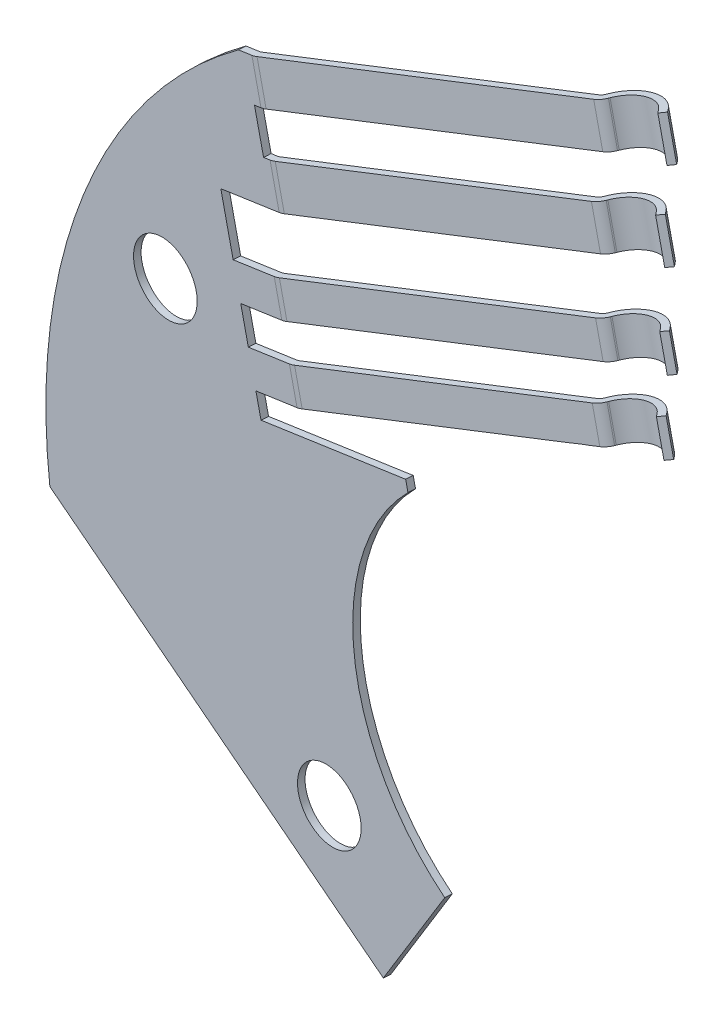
ISO-10303-21;
HEADER;
FILE_DESCRIPTION(('STEP AP214'),'2;1');
FILE_NAME('part.step','',(''),(''),'','','');
FILE_SCHEMA(('AUTOMOTIVE_DESIGN { 1 0 10303 214 1 1 1 1 }'));
ENDSEC;
DATA;
#1=APPLICATION_CONTEXT('core data for automotive mechanical design processes');
#2=APPLICATION_PROTOCOL_DEFINITION('international standard','automotive_design',2000,#1);
#3=PRODUCT_CONTEXT('',#1,'mechanical');
#4=PRODUCT('Part','Part','',(#3));
#5=PRODUCT_RELATED_PRODUCT_CATEGORY('part','',(#4));
#6=PRODUCT_DEFINITION_FORMATION('','',#4);
#7=PRODUCT_DEFINITION_CONTEXT('part definition',#1,'design');
#8=PRODUCT_DEFINITION('design','',#6,#7);
#9=PRODUCT_DEFINITION_SHAPE('','',#8);
#10=(LENGTH_UNIT() NAMED_UNIT(*) SI_UNIT(.MILLI.,.METRE.));
#11=(NAMED_UNIT(*) PLANE_ANGLE_UNIT() SI_UNIT($,.RADIAN.));
#12=(NAMED_UNIT(*) SI_UNIT($,.STERADIAN.) SOLID_ANGLE_UNIT());
#13=UNCERTAINTY_MEASURE_WITH_UNIT(LENGTH_MEASURE(1.E-05),#10,'distance_accuracy_value','');
#14=(GEOMETRIC_REPRESENTATION_CONTEXT(3) GLOBAL_UNCERTAINTY_ASSIGNED_CONTEXT((#13)) GLOBAL_UNIT_ASSIGNED_CONTEXT((#10,
#11,#12)) REPRESENTATION_CONTEXT('',''));
#15=CARTESIAN_POINT('',(0.,0.,0.));
#16=DIRECTION('',(0.,0.,1.));
#17=DIRECTION('',(1.,0.,0.));
#18=AXIS2_PLACEMENT_3D('',#15,#16,#17);
#19=CARTESIAN_POINT('',(-3.30472176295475,3.17404357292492,4.03647939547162));
#20=DIRECTION('',(-0.845294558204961,-0.188353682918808,-0.500000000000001));
#21=DIRECTION('',(-0.509112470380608,0.,0.860700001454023));
#22=AXIS2_PLACEMENT_3D('',#19,#20,#21);
#23=PLANE('',#22);
#24=DIRECTION('',(0.217492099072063,-0.976062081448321,0.));
#25=VECTOR('',#24,1.);
#26=CARTESIAN_POINT('',(-1.93756140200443,3.0278901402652,1.78023004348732));
#27=LINE('',#26,#25);
#28=CARTESIAN_POINT('',(-1.88318837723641,2.78387461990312,1.78023004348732));
#29=VERTEX_POINT('',#28);
#30=CARTESIAN_POINT('',(-1.99193442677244,3.27190566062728,1.78023004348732));
#31=VERTEX_POINT('',#30);
#32=EDGE_CURVE('E475',#29,#31,#27,.F.);
#33=ORIENTED_EDGE('',*,*,#32,.T.);
#34=DIRECTION('',(-0.488031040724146,-0.108746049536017,0.866025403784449));
#35=VECTOR('',#34,1.);
#36=CARTESIAN_POINT('',(-1.98351983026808,3.27378065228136,1.76529809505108));
#37=LINE('',#36,#35);
#38=CARTESIAN_POINT('',(-1.98351983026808,3.27378065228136,1.76529809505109));
#39=VERTEX_POINT('',#38);
#40=EDGE_CURVE('E688',#39,#31,#37,.T.);
#41=ORIENTED_EDGE('',*,*,#40,.F.);
#42=DIRECTION('',(-0.217492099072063,0.976062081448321,0.));
#43=VECTOR('',#42,1.);
#44=CARTESIAN_POINT('',(-1.92914680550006,3.02976513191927,1.76529809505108));
#45=LINE('',#44,#43);
#46=CARTESIAN_POINT('',(-1.87477378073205,2.7857496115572,1.76529809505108));
#47=VERTEX_POINT('',#46);
#48=EDGE_CURVE('E758',#47,#39,#45,.T.);
#49=ORIENTED_EDGE('',*,*,#48,.F.);
#50=DIRECTION('',(0.488031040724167,0.108746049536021,-0.866025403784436));
#51=VECTOR('',#50,1.);
#52=CARTESIAN_POINT('',(-1.88318837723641,2.78387461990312,1.78023004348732));
#53=LINE('',#52,#51);
#54=EDGE_CURVE('E691',#29,#47,#53,.T.);
#55=ORIENTED_EDGE('',*,*,#54,.F.);
#56=EDGE_LOOP('',(#33,#41,#49,#55));
#57=FACE_BOUND('',#56,.T.);
#58=ADVANCED_FACE('F17',(#57),#23,.T.);
#59=CARTESIAN_POINT('',(-1.50649952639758,3.12394197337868,2.01529809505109));
#60=DIRECTION('',(-0.217492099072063,0.976062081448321,0.));
#61=DIRECTION('',(-0.976062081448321,-0.217492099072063,0.));
#62=AXIS2_PLACEMENT_3D('',#59,#60,#61);
#63=CYLINDRICAL_SURFACE('',#62,0.4);
#64=DIRECTION('',(0.217492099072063,-0.976062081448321,0.));
#65=VECTOR('',#64,1.);
#66=CARTESIAN_POINT('',(-1.89899037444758,3.29261602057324,1.81529809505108));
#67=LINE('',#66,#65);
#68=CARTESIAN_POINT('',(-1.89899037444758,3.29261602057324,1.81529809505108));
#69=VERTEX_POINT('',#68);
#70=CARTESIAN_POINT('',(-1.79024432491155,2.80458497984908,1.81529809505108));
#71=VERTEX_POINT('',#70);
#72=EDGE_CURVE('E733',#69,#71,#67,.T.);
#73=ORIENTED_EDGE('',*,*,#72,.T.);
#74=CARTESIAN_POINT('',(-1.45212650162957,2.8799264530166,2.01529809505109));
#75=DIRECTION('',(-0.217492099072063,0.976062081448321,0.));
#76=DIRECTION('',(-0.976062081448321,-0.217492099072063,0.));
#77=AXIS2_PLACEMENT_3D('',#74,#75,#76);
#78=CIRCLE('',#77,0.4);
#79=CARTESIAN_POINT('',(-1.15304372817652,2.94656989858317,1.75818305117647));
#80=VERTEX_POINT('',#79);
#81=EDGE_CURVE('E464',#80,#71,#78,.T.);
#82=ORIENTED_EDGE('',*,*,#81,.F.);
#83=DIRECTION('',(-0.217492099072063,0.976062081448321,0.));
#84=VECTOR('',#83,1.);
#85=CARTESIAN_POINT('',(-1.15304372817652,2.94656989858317,1.75818305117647));
#86=LINE('',#85,#84);
#87=CARTESIAN_POINT('',(-1.26178977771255,3.43460093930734,1.75818305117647));
#88=VERTEX_POINT('',#87);
#89=EDGE_CURVE('E456',#80,#88,#86,.T.);
#90=ORIENTED_EDGE('',*,*,#89,.T.);
#91=CARTESIAN_POINT('',(-1.5608725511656,3.36795749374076,2.01529809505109));
#92=DIRECTION('',(-0.217492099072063,0.976062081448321,0.));
#93=DIRECTION('',(-0.976062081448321,-0.217492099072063,0.));
#94=AXIS2_PLACEMENT_3D('',#91,#92,#93);
#95=CIRCLE('',#94,0.4);
#96=EDGE_CURVE('E673',#69,#88,#95,.F.);
#97=ORIENTED_EDGE('',*,*,#96,.F.);
#98=EDGE_LOOP('',(#73,#82,#90,#97));
#99=FACE_BOUND('',#98,.T.);
#100=ADVANCED_FACE('F1073',(#99),#63,.F.);
#101=CARTESIAN_POINT('',(-3.48330126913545,3.1342513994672,-0.903785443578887));
#102=DIRECTION('',(0.747706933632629,0.166608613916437,-0.642787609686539));
#103=DIRECTION('',(-0.651899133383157,0.,-0.758305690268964));
#104=AXIS2_PLACEMENT_3D('',#101,#102,#103);
#105=PLANE('',#104);
#106=DIRECTION('',(-0.627400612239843,-0.139801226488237,-0.766044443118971));
#107=VECTOR('',#106,1.);
#108=CARTESIAN_POINT('',(-1.10674746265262,2.95688591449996,1.81470992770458));
#109=LINE('',#108,#107);
#110=CARTESIAN_POINT('',(-1.10674746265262,2.95688591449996,1.81470992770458));
#111=VERTEX_POINT('',#110);
#112=EDGE_CURVE('E459',#111,#80,#109,.T.);
#113=ORIENTED_EDGE('',*,*,#112,.F.);
#114=DIRECTION('',(0.217492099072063,-0.976062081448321,0.));
#115=VECTOR('',#114,1.);
#116=CARTESIAN_POINT('',(-1.21549351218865,3.44491695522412,1.81470992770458));
#117=LINE('',#116,#115);
#118=CARTESIAN_POINT('',(-1.21549351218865,3.44491695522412,1.81470992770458));
#119=VERTEX_POINT('',#118);
#120=EDGE_CURVE('E444',#119,#111,#117,.T.);
#121=ORIENTED_EDGE('',*,*,#120,.F.);
#122=DIRECTION('',(0.627400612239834,0.139801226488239,0.766044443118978));
#123=VECTOR('',#122,1.);
#124=CARTESIAN_POINT('',(-1.26178977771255,3.43460093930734,1.75818305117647));
#125=LINE('',#124,#123);
#126=EDGE_CURVE('E676',#88,#119,#125,.T.);
#127=ORIENTED_EDGE('',*,*,#126,.F.);
#128=ORIENTED_EDGE('',*,*,#89,.F.);
#129=EDGE_LOOP('',(#113,#121,#127,#128));
#130=FACE_BOUND('',#129,.T.);
#131=ADVANCED_FACE('F460',(#130),#105,.F.);
#132=CARTESIAN_POINT('',(-1.14072281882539,3.46157781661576,1.75043116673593));
#133=DIRECTION('',(0.627400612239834,0.139801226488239,0.766044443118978));
#134=DIRECTION('',(0.773641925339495,0.,-0.633623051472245));
#135=AXIS2_PLACEMENT_3D('',#132,#133,#134);
#136=PLANE('',#135);
#137=DIRECTION('',(0.217492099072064,-0.97606208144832,0.));
#138=VECTOR('',#137,1.);
#139=CARTESIAN_POINT('',(-1.14072281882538,3.46157781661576,1.75043116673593));
#140=LINE('',#139,#138);
#141=CARTESIAN_POINT('',(-1.14072281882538,3.46157781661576,1.75043116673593));
#142=VERTEX_POINT('',#141);
#143=CARTESIAN_POINT('',(-1.03197676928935,2.9735467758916,1.75043116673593));
#144=VERTEX_POINT('',#143);
#145=EDGE_CURVE('E455',#142,#144,#140,.T.);
#146=ORIENTED_EDGE('',*,*,#145,.F.);
#147=DIRECTION('',(0.747706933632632,0.166608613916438,-0.642787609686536));
#148=VECTOR('',#147,1.);
#149=CARTESIAN_POINT('',(-1.21549351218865,3.44491695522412,1.81470992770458));
#150=LINE('',#149,#148);
#151=EDGE_CURVE('E451',#119,#142,#150,.T.);
#152=ORIENTED_EDGE('',*,*,#151,.F.);
#153=ORIENTED_EDGE('',*,*,#120,.T.);
#154=DIRECTION('',(-0.747706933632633,-0.166608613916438,0.642787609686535));
#155=VECTOR('',#154,1.);
#156=CARTESIAN_POINT('',(-1.03197676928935,2.9735467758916,1.75043116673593));
#157=LINE('',#156,#155);
#158=EDGE_CURVE('E448',#144,#111,#157,.T.);
#159=ORIENTED_EDGE('',*,*,#158,.F.);
#160=EDGE_LOOP('',(#146,#152,#153,#159));
#161=FACE_BOUND('',#160,.T.);
#162=ADVANCED_FACE('F446',(#161),#136,.T.);
#163=CARTESIAN_POINT('',(-3.40853057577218,3.15091226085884,-0.968064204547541));
#164=DIRECTION('',(0.747706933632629,0.166608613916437,-0.642787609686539));
#165=DIRECTION('',(-0.651899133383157,0.,-0.758305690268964));
#166=AXIS2_PLACEMENT_3D('',#163,#164,#165);
#167=PLANE('',#166);
#168=ORIENTED_EDGE('',*,*,#145,.T.);
#169=DIRECTION('',(0.627400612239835,0.139801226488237,0.766044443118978));
#170=VECTOR('',#169,1.);
#171=CARTESIAN_POINT('',(-1.07827303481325,2.96323075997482,1.69390429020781));
#172=LINE('',#171,#170);
#173=CARTESIAN_POINT('',(-1.07827303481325,2.96323075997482,1.69390429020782));
#174=VERTEX_POINT('',#173);
#175=EDGE_CURVE('E469',#174,#144,#172,.T.);
#176=ORIENTED_EDGE('',*,*,#175,.F.);
#177=DIRECTION('',(-0.217492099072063,0.976062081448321,0.));
#178=VECTOR('',#177,1.);
#179=CARTESIAN_POINT('',(-1.13264605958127,3.2072462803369,1.69390429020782));
#180=LINE('',#179,#178);
#181=CARTESIAN_POINT('',(-1.18701908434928,3.45126180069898,1.69390429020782));
#182=VERTEX_POINT('',#181);
#183=EDGE_CURVE('E761',#182,#174,#180,.F.);
#184=ORIENTED_EDGE('',*,*,#183,.F.);
#185=DIRECTION('',(-0.627400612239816,-0.139801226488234,-0.766044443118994));
#186=VECTOR('',#185,1.);
#187=CARTESIAN_POINT('',(-1.14072281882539,3.46157781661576,1.75043116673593));
#188=LINE('',#187,#186);
#189=EDGE_CURVE('E672',#142,#182,#188,.T.);
#190=ORIENTED_EDGE('',*,*,#189,.F.);
#191=EDGE_LOOP('',(#168,#176,#184,#190));
#192=FACE_BOUND('',#191,.T.);
#193=ADVANCED_FACE('F1077',(#192),#167,.T.);
#194=CARTESIAN_POINT('',(-1.50649952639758,3.12394197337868,2.01529809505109));
#195=DIRECTION('',(-0.217492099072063,0.976062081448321,0.));
#196=DIRECTION('',(-0.976062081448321,-0.217492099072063,0.));
#197=AXIS2_PLACEMENT_3D('',#194,#195,#196);
#198=CYLINDRICAL_SURFACE('',#197,0.5);
#199=CARTESIAN_POINT('',(-1.45212650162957,2.8799264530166,2.01529809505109));
#200=DIRECTION('',(-0.217492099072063,0.976062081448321,0.));
#201=DIRECTION('',(-0.976062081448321,-0.217492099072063,0.));
#202=AXIS2_PLACEMENT_3D('',#199,#200,#201);
#203=CIRCLE('',#202,0.5);
#204=EDGE_CURVE('E471',#47,#174,#203,.F.);
#205=ORIENTED_EDGE('',*,*,#204,.F.);
#206=ORIENTED_EDGE('',*,*,#48,.T.);
#207=CARTESIAN_POINT('',(-1.5608725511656,3.36795749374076,2.01529809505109));
#208=DIRECTION('',(-0.217492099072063,0.976062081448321,0.));
#209=DIRECTION('',(-0.976062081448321,-0.217492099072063,0.));
#210=AXIS2_PLACEMENT_3D('',#207,#208,#209);
#211=CIRCLE('',#210,0.5);
#212=EDGE_CURVE('E669',#182,#39,#211,.T.);
#213=ORIENTED_EDGE('',*,*,#212,.F.);
#214=ORIENTED_EDGE('',*,*,#183,.T.);
#215=EDGE_LOOP('',(#205,#206,#213,#214));
#216=FACE_BOUND('',#215,.T.);
#217=ADVANCED_FACE('F1080',(#216),#198,.T.);
#218=CARTESIAN_POINT('',(-3.22019230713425,3.1928789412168,4.08647939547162));
#219=DIRECTION('',(-0.845294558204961,-0.188353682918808,-0.500000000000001));
#220=DIRECTION('',(-0.509112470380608,0.,0.860700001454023));
#221=AXIS2_PLACEMENT_3D('',#218,#219,#220);
#222=PLANE('',#221);
#223=DIRECTION('',(0.488031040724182,0.108746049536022,-0.866025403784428));
#224=VECTOR('',#223,1.);
#225=CARTESIAN_POINT('',(-1.90740497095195,3.29074102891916,1.83023004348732));
#226=LINE('',#225,#224);
#227=CARTESIAN_POINT('',(-1.90740497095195,3.29074102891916,1.83023004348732));
#228=VERTEX_POINT('',#227);
#229=EDGE_CURVE('E677',#228,#69,#226,.T.);
#230=ORIENTED_EDGE('',*,*,#229,.F.);
#231=DIRECTION('',(0.217492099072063,-0.976062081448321,0.));
#232=VECTOR('',#231,1.);
#233=CARTESIAN_POINT('',(-1.85303194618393,3.04672550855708,1.83023004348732));
#234=LINE('',#233,#232);
#235=CARTESIAN_POINT('',(-1.79865892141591,2.802709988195,1.83023004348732));
#236=VERTEX_POINT('',#235);
#237=EDGE_CURVE('E665',#236,#228,#234,.F.);
#238=ORIENTED_EDGE('',*,*,#237,.F.);
#239=DIRECTION('',(-0.488031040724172,-0.108746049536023,0.866025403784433));
#240=VECTOR('',#239,1.);
#241=CARTESIAN_POINT('',(-1.79024432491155,2.80458497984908,1.81529809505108));
#242=LINE('',#241,#240);
#243=EDGE_CURVE('E695',#71,#236,#242,.T.);
#244=ORIENTED_EDGE('',*,*,#243,.F.);
#245=ORIENTED_EDGE('',*,*,#72,.F.);
#246=EDGE_LOOP('',(#230,#238,#244,#245));
#247=FACE_BOUND('',#246,.T.);
#248=ADVANCED_FACE('F1070',(#247),#222,.F.);
#249=CARTESIAN_POINT('',(-1.0853648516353,6.55662694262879,1.65459337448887));
#250=DIRECTION('',(0.217492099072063,-0.976062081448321,0.));
#251=DIRECTION('',(0.976062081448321,0.217492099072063,0.));
#252=AXIS2_PLACEMENT_3D('',#249,#250,#251);
#253=PLANE('',#252);
#254=DIRECTION('',(-0.488031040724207,-0.108746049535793,0.866025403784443));
#255=VECTOR('',#254,1.);
#256=CARTESIAN_POINT('',(-1.92816186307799,6.36882977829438,1.66946030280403));
#257=LINE('',#256,#255);
#258=CARTESIAN_POINT('',(-1.928161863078,6.36882977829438,1.66946030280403));
#259=VERTEX_POINT('',#258);
#260=CARTESIAN_POINT('',(-1.93657645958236,6.36695478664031,1.68439225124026));
#261=VERTEX_POINT('',#260);
#262=EDGE_CURVE('E657',#259,#261,#257,.T.);
#263=ORIENTED_EDGE('',*,*,#262,.F.);
#264=CARTESIAN_POINT('',(-1.50551458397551,6.46300661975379,1.91946030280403));
#265=DIRECTION('',(0.217492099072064,-0.97606208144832,0.));
#266=DIRECTION('',(0.97606208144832,0.217492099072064,0.));
#267=AXIS2_PLACEMENT_3D('',#264,#265,#266);
#268=CIRCLE('',#267,0.5);
#269=CARTESIAN_POINT('',(-1.1316611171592,6.54631092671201,1.59806649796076));
#270=VERTEX_POINT('',#269);
#271=EDGE_CURVE('E658',#270,#259,#268,.F.);
#272=ORIENTED_EDGE('',*,*,#271,.F.);
#273=DIRECTION('',(-0.627400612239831,-0.139801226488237,-0.766044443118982));
#274=VECTOR('',#273,1.);
#275=CARTESIAN_POINT('',(-1.0853648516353,6.55662694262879,1.65459337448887));
#276=LINE('',#275,#274);
#277=CARTESIAN_POINT('',(-1.0853648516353,6.55662694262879,1.65459337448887));
#278=VERTEX_POINT('',#277);
#279=EDGE_CURVE('E745',#278,#270,#276,.T.);
#280=ORIENTED_EDGE('',*,*,#279,.F.);
#281=DIRECTION('',(0.747706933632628,0.166608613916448,-0.642787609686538));
#282=VECTOR('',#281,1.);
#283=CARTESIAN_POINT('',(-1.16013554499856,6.53996608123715,1.71887213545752));
#284=LINE('',#283,#282);
#285=CARTESIAN_POINT('',(-1.16013554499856,6.53996608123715,1.71887213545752));
#286=VERTEX_POINT('',#285);
#287=EDGE_CURVE('E750',#286,#278,#284,.T.);
#288=ORIENTED_EDGE('',*,*,#287,.F.);
#289=DIRECTION('',(-0.627400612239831,-0.139801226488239,-0.766044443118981));
#290=VECTOR('',#289,1.);
#291=CARTESIAN_POINT('',(-1.16013554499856,6.53996608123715,1.71887213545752));
#292=LINE('',#291,#290);
#293=CARTESIAN_POINT('',(-1.20643181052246,6.52965006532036,1.66234525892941));
#294=VERTEX_POINT('',#293);
#295=EDGE_CURVE('E757',#286,#294,#292,.T.);
#296=ORIENTED_EDGE('',*,*,#295,.T.);
#297=CARTESIAN_POINT('',(-1.50551458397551,6.46300661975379,1.91946030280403));
#298=DIRECTION('',(0.217492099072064,-0.97606208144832,0.));
#299=DIRECTION('',(0.97606208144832,0.217492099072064,0.));
#300=AXIS2_PLACEMENT_3D('',#297,#298,#299);
#301=CIRCLE('',#300,0.399999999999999);
#302=CARTESIAN_POINT('',(-1.84363240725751,6.38766514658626,1.71946030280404));
#303=VERTEX_POINT('',#302);
#304=EDGE_CURVE('E20',#294,#303,#301,.F.);
#305=ORIENTED_EDGE('',*,*,#304,.T.);
#306=DIRECTION('',(-0.488031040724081,-0.108746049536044,0.866025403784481));
#307=VECTOR('',#306,1.);
#308=CARTESIAN_POINT('',(-1.8436324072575,6.38766514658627,1.71946030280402));
#309=LINE('',#308,#307);
#310=CARTESIAN_POINT('',(-1.85204700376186,6.38579015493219,1.73439225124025));
#311=VERTEX_POINT('',#310);
#312=EDGE_CURVE('E726',#303,#311,#309,.T.);
#313=ORIENTED_EDGE('',*,*,#312,.T.);
#314=CARTESIAN_POINT('',(-2.02110591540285,6.34811941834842,1.63439225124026));
#315=DIRECTION('',(-0.217492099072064,0.97606208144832,0.));
#316=DIRECTION('',(-0.97606208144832,-0.217492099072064,0.));
#317=AXIS2_PLACEMENT_3D('',#314,#315,#316);
#318=CIRCLE('',#317,0.2);
#319=CARTESIAN_POINT('',(-1.97058122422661,6.35937763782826,1.82757741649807));
#320=VERTEX_POINT('',#319);
#321=EDGE_CURVE('E725',#311,#320,#318,.F.);
#322=ORIENTED_EDGE('',*,*,#321,.T.);
#323=DIRECTION('',(-0.942803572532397,-0.210081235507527,0.258819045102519));
#324=VECTOR('',#323,1.);
#325=CARTESIAN_POINT('',(-1.97058122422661,6.35937763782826,1.82757741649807));
#326=LINE('',#325,#324);
#327=CARTESIAN_POINT('',(-5.75288717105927,5.51658118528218,2.86589848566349));
#328=VERTEX_POINT('',#327);
#329=EDGE_CURVE('E1028',#320,#328,#326,.T.);
#330=ORIENTED_EDGE('',*,*,#329,.T.);
#331=CARTESIAN_POINT('',(-5.8034118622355,5.50532296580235,2.67271332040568));
#332=DIRECTION('',(-0.217492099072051,0.976062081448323,0.));
#333=DIRECTION('',(-0.976062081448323,-0.217492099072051,0.));
#334=AXIS2_PLACEMENT_3D('',#331,#332,#333);
#335=CIRCLE('',#334,0.2);
#336=CARTESIAN_POINT('',(-5.8204257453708,5.50153182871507,2.87195226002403));
#337=VERTEX_POINT('',#336);
#338=EDGE_CURVE('E723',#328,#337,#335,.F.);
#339=ORIENTED_EDGE('',*,*,#338,.T.);
#340=DIRECTION('',(-0.97234787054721,-0.216664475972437,-0.0871557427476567));
#341=VECTOR('',#340,1.);
#342=CARTESIAN_POINT('',(-5.82042574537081,5.50153182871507,2.87195226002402));
#343=LINE('',#342,#341);
#344=CARTESIAN_POINT('',(-5.92308999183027,5.47865555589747,2.86275001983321));
#345=VERTEX_POINT('',#344);
#346=EDGE_CURVE('E518',#337,#345,#343,.T.);
#347=ORIENTED_EDGE('',*,*,#346,.T.);
#348=DIRECTION('',(0.0850694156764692,0.0189556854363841,-0.996194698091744));
#349=VECTOR('',#348,1.);
#350=CARTESIAN_POINT('',(-5.92308999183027,5.47865555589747,2.86275001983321));
#351=LINE('',#350,#349);
#352=CARTESIAN_POINT('',(-5.91458305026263,5.48055112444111,2.76313055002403));
#353=VERTEX_POINT('',#352);
#354=EDGE_CURVE('E514',#345,#353,#351,.T.);
#355=ORIENTED_EDGE('',*,*,#354,.T.);
#356=DIRECTION('',(0.972347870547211,0.216664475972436,0.0871557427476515));
#357=VECTOR('',#356,1.);
#358=CARTESIAN_POINT('',(-5.91458305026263,5.48055112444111,2.76313055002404));
#359=LINE('',#358,#357);
#360=CARTESIAN_POINT('',(-5.81191880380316,5.50342739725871,2.77233279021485));
#361=VERTEX_POINT('',#360);
#362=EDGE_CURVE('E517',#353,#361,#359,.T.);
#363=ORIENTED_EDGE('',*,*,#362,.T.);
#364=CARTESIAN_POINT('',(-5.8034118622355,5.50532296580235,2.67271332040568));
#365=DIRECTION('',(-0.217492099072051,0.976062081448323,0.));
#366=DIRECTION('',(-0.976062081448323,-0.217492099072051,0.));
#367=AXIS2_PLACEMENT_3D('',#364,#365,#366);
#368=CIRCLE('',#367,0.1);
#369=CARTESIAN_POINT('',(-5.77814951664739,5.51095207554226,2.76930590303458));
#370=VERTEX_POINT('',#369);
#371=EDGE_CURVE('E721',#361,#370,#368,.T.);
#372=ORIENTED_EDGE('',*,*,#371,.T.);
#373=DIRECTION('',(-0.942803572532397,-0.210081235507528,0.258819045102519));
#374=VECTOR('',#373,1.);
#375=CARTESIAN_POINT('',(-1.99584356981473,6.35374852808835,1.73098483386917));
#376=LINE('',#375,#374);
#377=CARTESIAN_POINT('',(-1.99584356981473,6.35374852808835,1.73098483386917));
#378=VERTEX_POINT('',#377);
#379=EDGE_CURVE('E738',#378,#370,#376,.T.);
#380=ORIENTED_EDGE('',*,*,#379,.F.);
#381=CARTESIAN_POINT('',(-2.02110591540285,6.34811941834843,1.63439225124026));
#382=DIRECTION('',(-0.217492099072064,0.97606208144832,0.));
#383=DIRECTION('',(-0.97606208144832,-0.217492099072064,0.));
#384=AXIS2_PLACEMENT_3D('',#381,#382,#383);
#385=CIRCLE('',#384,0.1);
#386=EDGE_CURVE('E654',#378,#261,#385,.T.);
#387=ORIENTED_EDGE('',*,*,#386,.T.);
#388=EDGE_LOOP('',(#263,#272,#280,#288,#296,#305,#313,#322,#330,#339,#347,#355,#363,#372,#380,#387));
#389=FACE_BOUND('',#388,.T.);
#390=ADVANCED_FACE('F875',(#389),#253,.T.);
#391=CARTESIAN_POINT('',(-1.05449140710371,5.33688086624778,1.71760182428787));
#392=DIRECTION('',(0.217492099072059,-0.976062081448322,0.));
#393=DIRECTION('',(0.976062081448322,0.217492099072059,0.));
#394=AXIS2_PLACEMENT_3D('',#391,#392,#393);
#395=PLANE('',#394);
#396=DIRECTION('',(-0.488031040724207,-0.108746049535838,0.866025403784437));
#397=VECTOR('',#396,1.);
#398=CARTESIAN_POINT('',(-1.8972884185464,5.14908370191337,1.73246875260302));
#399=LINE('',#398,#397);
#400=CARTESIAN_POINT('',(-1.8972884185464,5.14908370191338,1.73246875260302));
#401=VERTEX_POINT('',#400);
#402=CARTESIAN_POINT('',(-1.90570301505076,5.14720871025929,1.74740070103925));
#403=VERTEX_POINT('',#402);
#404=EDGE_CURVE('E649',#401,#403,#399,.T.);
#405=ORIENTED_EDGE('',*,*,#404,.F.);
#406=CARTESIAN_POINT('',(-1.47464113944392,5.24326054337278,1.98246875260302));
#407=DIRECTION('',(0.217492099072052,-0.976062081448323,0.));
#408=DIRECTION('',(0.976062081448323,0.217492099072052,0.));
#409=AXIS2_PLACEMENT_3D('',#406,#407,#408);
#410=CIRCLE('',#409,0.5);
#411=CARTESIAN_POINT('',(-1.10078767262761,5.32656485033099,1.66107494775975));
#412=VERTEX_POINT('',#411);
#413=EDGE_CURVE('E650',#412,#401,#410,.F.);
#414=ORIENTED_EDGE('',*,*,#413,.F.);
#415=DIRECTION('',(-0.627400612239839,-0.139801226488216,-0.766044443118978));
#416=VECTOR('',#415,1.);
#417=CARTESIAN_POINT('',(-1.05449140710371,5.33688086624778,1.71760182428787));
#418=LINE('',#417,#416);
#419=CARTESIAN_POINT('',(-1.05449140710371,5.33688086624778,1.71760182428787));
#420=VERTEX_POINT('',#419);
#421=EDGE_CURVE('E858',#420,#412,#418,.T.);
#422=ORIENTED_EDGE('',*,*,#421,.F.);
#423=DIRECTION('',(0.747706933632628,0.166608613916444,-0.642787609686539));
#424=VECTOR('',#423,1.);
#425=CARTESIAN_POINT('',(-1.12926210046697,5.32022000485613,1.78188058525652));
#426=LINE('',#425,#424);
#427=CARTESIAN_POINT('',(-1.12926210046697,5.32022000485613,1.78188058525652));
#428=VERTEX_POINT('',#427);
#429=EDGE_CURVE('E863',#428,#420,#426,.T.);
#430=ORIENTED_EDGE('',*,*,#429,.F.);
#431=DIRECTION('',(-0.627400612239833,-0.139801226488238,-0.766044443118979));
#432=VECTOR('',#431,1.);
#433=CARTESIAN_POINT('',(-1.12926210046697,5.32022000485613,1.78188058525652));
#434=LINE('',#433,#432);
#435=CARTESIAN_POINT('',(-1.17555836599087,5.30990398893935,1.72535370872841));
#436=VERTEX_POINT('',#435);
#437=EDGE_CURVE('E402',#428,#436,#434,.T.);
#438=ORIENTED_EDGE('',*,*,#437,.T.);
#439=CARTESIAN_POINT('',(-1.47464113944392,5.24326054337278,1.98246875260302));
#440=DIRECTION('',(0.217492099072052,-0.976062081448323,0.));
#441=DIRECTION('',(0.976062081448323,0.217492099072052,0.));
#442=AXIS2_PLACEMENT_3D('',#439,#440,#441);
#443=CIRCLE('',#442,0.4);
#444=CARTESIAN_POINT('',(-1.8127589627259,5.16791907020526,1.78246875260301));
#445=VERTEX_POINT('',#444);
#446=EDGE_CURVE('E718',#436,#445,#443,.F.);
#447=ORIENTED_EDGE('',*,*,#446,.T.);
#448=DIRECTION('',(-0.488031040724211,-0.108746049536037,0.866025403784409));
#449=VECTOR('',#448,1.);
#450=CARTESIAN_POINT('',(-1.8127589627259,5.16791907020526,1.78246875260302));
#451=LINE('',#450,#449);
#452=CARTESIAN_POINT('',(-1.82117355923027,5.16604407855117,1.79740070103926));
#453=VERTEX_POINT('',#452);
#454=EDGE_CURVE('E717',#445,#453,#451,.T.);
#455=ORIENTED_EDGE('',*,*,#454,.T.);
#456=CARTESIAN_POINT('',(-1.99023247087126,5.12837334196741,1.69740070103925));
#457=DIRECTION('',(-0.217492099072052,0.976062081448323,0.));
#458=DIRECTION('',(-0.976062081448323,-0.217492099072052,0.));
#459=AXIS2_PLACEMENT_3D('',#456,#457,#458);
#460=CIRCLE('',#459,0.2);
#461=CARTESIAN_POINT('',(-1.93970777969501,5.13963156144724,1.89058586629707));
#462=VERTEX_POINT('',#461);
#463=EDGE_CURVE('E715',#453,#462,#460,.F.);
#464=ORIENTED_EDGE('',*,*,#463,.T.);
#465=DIRECTION('',(-0.942803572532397,-0.210081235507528,0.258819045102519));
#466=VECTOR('',#465,1.);
#467=CARTESIAN_POINT('',(-1.93970777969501,5.13963156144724,1.89058586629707));
#468=LINE('',#467,#466);
#469=CARTESIAN_POINT('',(-5.49249200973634,4.34797853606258,2.86589848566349));
#470=VERTEX_POINT('',#469);
#471=EDGE_CURVE('E991',#462,#470,#468,.T.);
#472=ORIENTED_EDGE('',*,*,#471,.T.);
#473=CARTESIAN_POINT('',(-5.54301670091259,4.33672031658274,2.67271332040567));
#474=DIRECTION('',(-0.217492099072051,0.976062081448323,0.));
#475=DIRECTION('',(-0.976062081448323,-0.217492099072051,0.));
#476=AXIS2_PLACEMENT_3D('',#473,#474,#475);
#477=CIRCLE('',#476,0.2);
#478=CARTESIAN_POINT('',(-5.56003058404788,4.33292917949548,2.87195226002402));
#479=VERTEX_POINT('',#478);
#480=EDGE_CURVE('E712',#470,#479,#477,.F.);
#481=ORIENTED_EDGE('',*,*,#480,.T.);
#482=DIRECTION('',(-0.972347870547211,-0.216664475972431,-0.0871557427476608));
#483=VECTOR('',#482,1.);
#484=CARTESIAN_POINT('',(-5.56003058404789,4.3329291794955,2.87195226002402));
#485=LINE('',#484,#483);
#486=CARTESIAN_POINT('',(-6.47836834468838,4.12829956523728,2.7896376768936));
#487=VERTEX_POINT('',#486);
#488=EDGE_CURVE('E511',#479,#487,#485,.T.);
#489=ORIENTED_EDGE('',*,*,#488,.T.);
#490=DIRECTION('',(0.0850694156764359,0.018955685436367,-0.996194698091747));
#491=VECTOR('',#490,1.);
#492=CARTESIAN_POINT('',(-6.47836834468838,4.12829956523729,2.7896376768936));
#493=LINE('',#492,#491);
#494=CARTESIAN_POINT('',(-6.46986140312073,4.13019513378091,2.69001820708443));
#495=VERTEX_POINT('',#494);
#496=EDGE_CURVE('E507',#487,#495,#493,.T.);
#497=ORIENTED_EDGE('',*,*,#496,.T.);
#498=DIRECTION('',(0.972347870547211,0.21666447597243,0.0871557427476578));
#499=VECTOR('',#498,1.);
#500=CARTESIAN_POINT('',(-6.46986140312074,4.13019513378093,2.69001820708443));
#501=LINE('',#500,#499);
#502=CARTESIAN_POINT('',(-5.55152364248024,4.33482474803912,2.77233279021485));
#503=VERTEX_POINT('',#502);
#504=EDGE_CURVE('E510',#495,#503,#501,.T.);
#505=ORIENTED_EDGE('',*,*,#504,.T.);
#506=CARTESIAN_POINT('',(-5.54301670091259,4.33672031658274,2.67271332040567));
#507=DIRECTION('',(-0.217492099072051,0.976062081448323,0.));
#508=DIRECTION('',(-0.976062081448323,-0.217492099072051,0.));
#509=AXIS2_PLACEMENT_3D('',#506,#507,#508);
#510=CIRCLE('',#509,0.1);
#511=CARTESIAN_POINT('',(-5.51775435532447,4.34234942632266,2.76930590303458));
#512=VERTEX_POINT('',#511);
#513=EDGE_CURVE('E710',#503,#512,#510,.T.);
#514=ORIENTED_EDGE('',*,*,#513,.T.);
#515=DIRECTION('',(-0.942803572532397,-0.210081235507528,0.258819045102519));
#516=VECTOR('',#515,1.);
#517=CARTESIAN_POINT('',(-1.96497012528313,5.13400245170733,1.79399328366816));
#518=LINE('',#517,#516);
#519=CARTESIAN_POINT('',(-1.96497012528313,5.13400245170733,1.79399328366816));
#520=VERTEX_POINT('',#519);
#521=EDGE_CURVE('E851',#520,#512,#518,.T.);
#522=ORIENTED_EDGE('',*,*,#521,.F.);
#523=CARTESIAN_POINT('',(-1.99023247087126,5.12837334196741,1.69740070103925));
#524=DIRECTION('',(-0.217492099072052,0.976062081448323,0.));
#525=DIRECTION('',(-0.976062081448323,-0.217492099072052,0.));
#526=AXIS2_PLACEMENT_3D('',#523,#524,#525);
#527=CIRCLE('',#526,0.1);
#528=EDGE_CURVE('E646',#520,#403,#527,.T.);
#529=ORIENTED_EDGE('',*,*,#528,.T.);
#530=EDGE_LOOP('',(#405,#414,#422,#430,#438,#447,#455,#464,#472,#481,#489,#497,#505,#514,#522,#529));
#531=FACE_BOUND('',#530,.T.);
#532=ADVANCED_FACE('F1331',(#531),#395,.T.);
#533=CARTESIAN_POINT('',(-4.24435023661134,3.79369639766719,5.70342968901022));
#534=DIRECTION('',(-0.217492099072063,0.976062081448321,0.));
#535=DIRECTION('',(-0.976062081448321,-0.217492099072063,0.));
#536=AXIS2_PLACEMENT_3D('',#533,#534,#535);
#537=PLANE('',#536);
#538=DIRECTION('',(-0.627400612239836,-0.139801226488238,-0.766044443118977));
#539=VECTOR('',#538,1.);
#540=CARTESIAN_POINT('',(-1.15013678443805,4.48316788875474,1.69335821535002));
#541=LINE('',#540,#539);
#542=CARTESIAN_POINT('',(-1.15013678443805,4.48316788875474,1.69335821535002));
#543=VERTEX_POINT('',#542);
#544=CARTESIAN_POINT('',(-1.19643304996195,4.47285187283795,1.63683133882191));
#545=VERTEX_POINT('',#544);
#546=EDGE_CURVE('E482',#543,#545,#541,.T.);
#547=ORIENTED_EDGE('',*,*,#546,.T.);
#548=CARTESIAN_POINT('',(-1.57028651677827,4.38954756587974,1.95822514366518));
#549=DIRECTION('',(-0.217492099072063,0.976062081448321,0.));
#550=DIRECTION('',(-0.976062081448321,-0.217492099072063,0.));
#551=AXIS2_PLACEMENT_3D('',#548,#549,#550);
#552=CIRCLE('',#551,0.500000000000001);
#553=CARTESIAN_POINT('',(-1.99293379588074,4.29537072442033,1.70822514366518));
#554=VERTEX_POINT('',#553);
#555=EDGE_CURVE('E696',#545,#554,#552,.T.);
#556=ORIENTED_EDGE('',*,*,#555,.T.);
#557=DIRECTION('',(-0.488031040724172,-0.108746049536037,0.866025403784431));
#558=VECTOR('',#557,1.);
#559=CARTESIAN_POINT('',(-1.99293379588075,4.29537072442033,1.70822514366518));
#560=LINE('',#559,#558);
#561=CARTESIAN_POINT('',(-2.00134839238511,4.29349573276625,1.72315709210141));
#562=VERTEX_POINT('',#561);
#563=EDGE_CURVE('E709',#554,#562,#560,.T.);
#564=ORIENTED_EDGE('',*,*,#563,.T.);
#565=CARTESIAN_POINT('',(-2.08587784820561,4.27466036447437,1.67315709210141));
#566=DIRECTION('',(-0.217492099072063,0.976062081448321,0.));
#567=DIRECTION('',(-0.976062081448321,-0.217492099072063,0.));
#568=AXIS2_PLACEMENT_3D('',#565,#566,#567);
#569=CIRCLE('',#568,0.1);
#570=CARTESIAN_POINT('',(-2.06061550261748,4.28028947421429,1.76974967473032));
#571=VERTEX_POINT('',#570);
#572=EDGE_CURVE('E707',#562,#571,#569,.F.);
#573=ORIENTED_EDGE('',*,*,#572,.T.);
#574=DIRECTION('',(0.942803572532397,0.210081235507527,-0.258819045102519));
#575=VECTOR('',#574,1.);
#576=CARTESIAN_POINT('',(-5.61293702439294,3.48873955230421,2.74493527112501));
#577=LINE('',#576,#575);
#578=CARTESIAN_POINT('',(-5.61293702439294,3.48873955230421,2.74493527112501));
#579=VERTEX_POINT('',#578);
#580=EDGE_CURVE('E813',#579,#571,#577,.T.);
#581=ORIENTED_EDGE('',*,*,#580,.F.);
#582=CARTESIAN_POINT('',(-5.63819936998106,3.48311044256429,2.6483426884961));
#583=DIRECTION('',(-0.217492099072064,0.97606208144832,0.));
#584=DIRECTION('',(-0.97606208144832,-0.217492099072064,0.));
#585=AXIS2_PLACEMENT_3D('',#582,#583,#584);
#586=CIRCLE('',#585,0.1);
#587=CARTESIAN_POINT('',(-5.6467063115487,3.48121487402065,2.74796215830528));
#588=VERTEX_POINT('',#587);
#589=EDGE_CURVE('E704',#579,#588,#586,.F.);
#590=ORIENTED_EDGE('',*,*,#589,.T.);
#591=DIRECTION('',(-0.972347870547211,-0.216664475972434,-0.0871557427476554));
#592=VECTOR('',#591,1.);
#593=CARTESIAN_POINT('',(-5.6467063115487,3.48121487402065,2.74796215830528));
#594=LINE('',#593,#592);
#595=CARTESIAN_POINT('',(-6.29315456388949,3.33716933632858,2.69001820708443));
#596=VERTEX_POINT('',#595);
#597=EDGE_CURVE('E497',#588,#596,#594,.T.);
#598=ORIENTED_EDGE('',*,*,#597,.T.);
#599=DIRECTION('',(-0.0850694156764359,-0.0189556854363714,0.996194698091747));
#600=VECTOR('',#599,1.);
#601=CARTESIAN_POINT('',(-6.29315456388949,3.33716933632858,2.69001820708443));
#602=LINE('',#601,#600);
#603=CARTESIAN_POINT('',(-6.30166150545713,3.33527376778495,2.7896376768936));
#604=VERTEX_POINT('',#603);
#605=EDGE_CURVE('E493',#596,#604,#602,.T.);
#606=ORIENTED_EDGE('',*,*,#605,.T.);
#607=DIRECTION('',(0.97234787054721,0.216664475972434,0.0871557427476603));
#608=VECTOR('',#607,1.);
#609=CARTESIAN_POINT('',(-6.30166150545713,3.33527376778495,2.7896376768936));
#610=LINE('',#609,#608);
#611=CARTESIAN_POINT('',(-5.65521325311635,3.47931930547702,2.84758162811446));
#612=VERTEX_POINT('',#611);
#613=EDGE_CURVE('E496',#604,#612,#610,.T.);
#614=ORIENTED_EDGE('',*,*,#613,.T.);
#615=CARTESIAN_POINT('',(-5.63819936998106,3.48311044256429,2.6483426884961));
#616=DIRECTION('',(-0.217492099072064,0.97606208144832,0.));
#617=DIRECTION('',(-0.97606208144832,-0.217492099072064,0.));
#618=AXIS2_PLACEMENT_3D('',#615,#616,#617);
#619=CIRCLE('',#618,0.2);
#620=CARTESIAN_POINT('',(-5.58767467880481,3.49436866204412,2.84152785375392));
#621=VERTEX_POINT('',#620);
#622=EDGE_CURVE('E702',#612,#621,#619,.T.);
#623=ORIENTED_EDGE('',*,*,#622,.T.);
#624=DIRECTION('',(0.942803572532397,0.210081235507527,-0.258819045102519));
#625=VECTOR('',#624,1.);
#626=CARTESIAN_POINT('',(-5.58767467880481,3.49436866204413,2.84152785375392));
#627=LINE('',#626,#625);
#628=CARTESIAN_POINT('',(-2.03535315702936,4.28591858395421,1.86634225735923));
#629=VERTEX_POINT('',#628);
#630=EDGE_CURVE('E644',#621,#629,#627,.T.);
#631=ORIENTED_EDGE('',*,*,#630,.T.);
#632=CARTESIAN_POINT('',(-2.08587784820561,4.27466036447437,1.67315709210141));
#633=DIRECTION('',(-0.217492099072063,0.976062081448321,0.));
#634=DIRECTION('',(-0.976062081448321,-0.217492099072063,0.));
#635=AXIS2_PLACEMENT_3D('',#632,#633,#634);
#636=CIRCLE('',#635,0.2);
#637=CARTESIAN_POINT('',(-1.91681893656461,4.31233110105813,1.77315709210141));
#638=VERTEX_POINT('',#637);
#639=EDGE_CURVE('E641',#638,#629,#636,.F.);
#640=ORIENTED_EDGE('',*,*,#639,.F.);
#641=DIRECTION('',(0.488031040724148,0.10874604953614,-0.866025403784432));
#642=VECTOR('',#641,1.);
#643=CARTESIAN_POINT('',(-1.91681893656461,4.31233110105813,1.77315709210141));
#644=LINE('',#643,#642);
#645=CARTESIAN_POINT('',(-1.90840434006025,4.31420609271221,1.75822514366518));
#646=VERTEX_POINT('',#645);
#647=EDGE_CURVE('E809',#638,#646,#644,.T.);
#648=ORIENTED_EDGE('',*,*,#647,.T.);
#649=CARTESIAN_POINT('',(-1.57028651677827,4.38954756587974,1.95822514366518));
#650=DIRECTION('',(-0.217492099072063,0.976062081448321,0.));
#651=DIRECTION('',(-0.976062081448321,-0.217492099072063,0.));
#652=AXIS2_PLACEMENT_3D('',#649,#650,#651);
#653=CIRCLE('',#652,0.400000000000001);
#654=CARTESIAN_POINT('',(-1.27120374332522,4.45619101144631,1.70111009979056));
#655=VERTEX_POINT('',#654);
#656=EDGE_CURVE('E699',#646,#655,#653,.F.);
#657=ORIENTED_EDGE('',*,*,#656,.T.);
#658=DIRECTION('',(0.627400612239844,0.139801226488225,0.766044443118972));
#659=VECTOR('',#658,1.);
#660=CARTESIAN_POINT('',(-1.27120374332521,4.45619101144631,1.70111009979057));
#661=LINE('',#660,#659);
#662=CARTESIAN_POINT('',(-1.22490747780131,4.46650702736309,1.75763697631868));
#663=VERTEX_POINT('',#662);
#664=EDGE_CURVE('E483',#655,#663,#661,.T.);
#665=ORIENTED_EDGE('',*,*,#664,.T.);
#666=DIRECTION('',(0.747706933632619,0.166608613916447,-0.642787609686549));
#667=VECTOR('',#666,1.);
#668=CARTESIAN_POINT('',(-1.22490747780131,4.46650702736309,1.75763697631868));
#669=LINE('',#668,#667);
#670=EDGE_CURVE('E479',#663,#543,#669,.T.);
#671=ORIENTED_EDGE('',*,*,#670,.T.);
#672=EDGE_LOOP('',(#547,#556,#564,#573,#581,#590,#598,#606,#614,#623,#631,#640,#648,#657,#665,#671));
#673=FACE_BOUND('',#672,.T.);
#674=ADVANCED_FACE('F1362',(#673),#537,.T.);
#675=CARTESIAN_POINT('',(-2.02209085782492,3.00905477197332,1.73023004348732));
#676=DIRECTION('',(0.217492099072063,-0.976062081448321,0.));
#677=DIRECTION('',(0.976062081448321,0.217492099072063,0.));
#678=AXIS2_PLACEMENT_3D('',#675,#676,#677);
#679=CYLINDRICAL_SURFACE('',#678,0.1);
#680=ORIENTED_EDGE('',*,*,#32,.F.);
#681=CARTESIAN_POINT('',(-1.96771783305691,2.76503925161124,1.73023004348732));
#682=DIRECTION('',(0.217492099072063,-0.976062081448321,0.));
#683=DIRECTION('',(0.976062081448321,0.217492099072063,0.));
#684=AXIS2_PLACEMENT_3D('',#681,#682,#683);
#685=CIRCLE('',#684,0.1);
#686=CARTESIAN_POINT('',(-1.94245548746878,2.77066836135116,1.82682262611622));
#687=VERTEX_POINT('',#686);
#688=EDGE_CURVE('E692',#687,#29,#685,.F.);
#689=ORIENTED_EDGE('',*,*,#688,.F.);
#690=DIRECTION('',(0.217492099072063,-0.976062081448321,0.));
#691=VECTOR('',#690,1.);
#692=CARTESIAN_POINT('',(-2.05120153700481,3.25869940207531,1.82682262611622));
#693=LINE('',#692,#691);
#694=CARTESIAN_POINT('',(-2.05120153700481,3.25869940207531,1.82682262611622));
#695=VERTEX_POINT('',#694);
#696=EDGE_CURVE('E804',#695,#687,#693,.T.);
#697=ORIENTED_EDGE('',*,*,#696,.F.);
#698=CARTESIAN_POINT('',(-2.07646388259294,3.2530702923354,1.73023004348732));
#699=DIRECTION('',(0.217492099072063,-0.976062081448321,0.));
#700=DIRECTION('',(0.976062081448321,0.217492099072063,0.));
#701=AXIS2_PLACEMENT_3D('',#698,#699,#700);
#702=CIRCLE('',#701,0.1);
#703=EDGE_CURVE('E685',#31,#695,#702,.T.);
#704=ORIENTED_EDGE('',*,*,#703,.F.);
#705=EDGE_LOOP('',(#680,#689,#697,#704));
#706=FACE_BOUND('',#705,.T.);
#707=ADVANCED_FACE('F1841',(#706),#679,.F.);
#708=CARTESIAN_POINT('',(-0.946337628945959,2.99262941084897,1.55336770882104));
#709=DIRECTION('',(0.217492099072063,-0.976062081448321,0.));
#710=DIRECTION('',(0.976062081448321,0.217492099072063,0.));
#711=AXIS2_PLACEMENT_3D('',#708,#709,#710);
#712=PLANE('',#711);
#713=ORIENTED_EDGE('',*,*,#112,.T.);
#714=ORIENTED_EDGE('',*,*,#81,.T.);
#715=ORIENTED_EDGE('',*,*,#243,.T.);
#716=CARTESIAN_POINT('',(-1.96771783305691,2.76503925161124,1.73023004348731));
#717=DIRECTION('',(0.217492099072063,-0.976062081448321,0.));
#718=DIRECTION('',(0.976062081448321,0.217492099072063,0.));
#719=AXIS2_PLACEMENT_3D('',#716,#717,#718);
#720=CIRCLE('',#719,0.199999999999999);
#721=CARTESIAN_POINT('',(-1.91719314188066,2.77629747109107,1.92341520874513));
#722=VERTEX_POINT('',#721);
#723=EDGE_CURVE('E662',#722,#236,#720,.F.);
#724=ORIENTED_EDGE('',*,*,#723,.F.);
#725=DIRECTION('',(-0.942803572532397,-0.210081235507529,0.25881904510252));
#726=VECTOR('',#725,1.);
#727=CARTESIAN_POINT('',(-1.91719314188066,2.77629747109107,1.92341520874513));
#728=LINE('',#727,#726);
#729=CARTESIAN_POINT('',(-2.03033409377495,2.75108671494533,1.95447473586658));
#730=VERTEX_POINT('',#729);
#731=EDGE_CURVE('E637',#722,#730,#728,.T.);
#732=ORIENTED_EDGE('',*,*,#731,.T.);
#733=DIRECTION('',(0.252623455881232,0.056291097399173,0.965925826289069));
#734=VECTOR('',#733,1.);
#735=CARTESIAN_POINT('',(-2.05559643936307,2.74545760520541,1.85788215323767));
#736=LINE('',#735,#734);
#737=CARTESIAN_POINT('',(-2.05559643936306,2.74545760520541,1.85788215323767));
#738=VERTEX_POINT('',#737);
#739=EDGE_CURVE('E640',#730,#738,#736,.F.);
#740=ORIENTED_EDGE('',*,*,#739,.T.);
#741=DIRECTION('',(-0.942803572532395,-0.210081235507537,0.25881904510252));
#742=VECTOR('',#741,1.);
#743=CARTESIAN_POINT('',(-1.94245548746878,2.77066836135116,1.82682262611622));
#744=LINE('',#743,#742);
#745=EDGE_CURVE('E807',#687,#738,#744,.T.);
#746=ORIENTED_EDGE('',*,*,#745,.F.);
#747=ORIENTED_EDGE('',*,*,#688,.T.);
#748=ORIENTED_EDGE('',*,*,#54,.T.);
#749=ORIENTED_EDGE('',*,*,#204,.T.);
#750=ORIENTED_EDGE('',*,*,#175,.T.);
#751=ORIENTED_EDGE('',*,*,#158,.T.);
#752=EDGE_LOOP('',(#713,#714,#715,#724,#732,#740,#746,#747,#748,#749,#750,#751));
#753=FACE_BOUND('',#752,.T.);
#754=ADVANCED_FACE('F466',(#753),#712,.T.);
#755=CARTESIAN_POINT('',(-1.98993815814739,3.27235048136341,1.81000456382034));
#756=DIRECTION('',(-0.217492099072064,0.97606208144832,0.));
#757=DIRECTION('',(-0.97606208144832,-0.217492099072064,0.));
#758=AXIS2_PLACEMENT_3D('',#755,#756,#757);
#759=PLANE('',#758);
#760=ORIENTED_EDGE('',*,*,#189,.T.);
#761=ORIENTED_EDGE('',*,*,#212,.T.);
#762=ORIENTED_EDGE('',*,*,#40,.T.);
#763=ORIENTED_EDGE('',*,*,#703,.T.);
#764=DIRECTION('',(0.942803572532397,0.210081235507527,-0.258819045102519));
#765=VECTOR('',#764,1.);
#766=CARTESIAN_POINT('',(-5.39562266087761,2.51347511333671,2.74493527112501));
#767=LINE('',#766,#765);
#768=CARTESIAN_POINT('',(-5.39562266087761,2.51347511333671,2.74493527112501));
#769=VERTEX_POINT('',#768);
#770=EDGE_CURVE('E792',#769,#695,#767,.T.);
#771=ORIENTED_EDGE('',*,*,#770,.F.);
#772=CARTESIAN_POINT('',(-5.42088500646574,2.50784600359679,2.6483426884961));
#773=DIRECTION('',(-0.217492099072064,0.97606208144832,0.));
#774=DIRECTION('',(-0.97606208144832,-0.217492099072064,0.));
#775=AXIS2_PLACEMENT_3D('',#772,#773,#774);
#776=CIRCLE('',#775,0.1);
#777=CARTESIAN_POINT('',(-5.42939194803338,2.50595043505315,2.74796215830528));
#778=VERTEX_POINT('',#777);
#779=EDGE_CURVE('E681',#769,#778,#776,.F.);
#780=ORIENTED_EDGE('',*,*,#779,.T.);
#781=DIRECTION('',(-0.97234787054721,-0.216664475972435,-0.0871557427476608));
#782=VECTOR('',#781,1.);
#783=CARTESIAN_POINT('',(-5.42939194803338,2.50595043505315,2.74796215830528));
#784=LINE('',#783,#782);
#785=CARTESIAN_POINT('',(-6.07584020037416,2.36190489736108,2.69001820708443));
#786=VERTEX_POINT('',#785);
#787=EDGE_CURVE('E684',#778,#786,#784,.T.);
#788=ORIENTED_EDGE('',*,*,#787,.T.);
#789=DIRECTION('',(-0.0850694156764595,-0.0189556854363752,0.996194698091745));
#790=VECTOR('',#789,1.);
#791=CARTESIAN_POINT('',(-6.07584020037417,2.36190489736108,2.69001820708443));
#792=LINE('',#791,#790);
#793=CARTESIAN_POINT('',(-6.08434714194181,2.36000932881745,2.7896376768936));
#794=VERTEX_POINT('',#793);
#795=EDGE_CURVE('E773',#786,#794,#792,.T.);
#796=ORIENTED_EDGE('',*,*,#795,.T.);
#797=DIRECTION('',(0.97234787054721,0.216664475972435,0.087155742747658));
#798=VECTOR('',#797,1.);
#799=CARTESIAN_POINT('',(-6.08434714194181,2.36000932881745,2.7896376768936));
#800=LINE('',#799,#798);
#801=CARTESIAN_POINT('',(-5.43789888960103,2.50405486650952,2.84758162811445));
#802=VERTEX_POINT('',#801);
#803=EDGE_CURVE('E680',#794,#802,#800,.T.);
#804=ORIENTED_EDGE('',*,*,#803,.T.);
#805=CARTESIAN_POINT('',(-5.42088500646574,2.50784600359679,2.6483426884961));
#806=DIRECTION('',(-0.217492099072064,0.97606208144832,0.));
#807=DIRECTION('',(-0.97606208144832,-0.217492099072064,0.));
#808=AXIS2_PLACEMENT_3D('',#805,#806,#807);
#809=CIRCLE('',#808,0.2);
#810=CARTESIAN_POINT('',(-5.37036031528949,2.51910422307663,2.84152785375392));
#811=VERTEX_POINT('',#810);
#812=EDGE_CURVE('E678',#802,#811,#809,.T.);
#813=ORIENTED_EDGE('',*,*,#812,.T.);
#814=DIRECTION('',(0.942803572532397,0.210081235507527,-0.258819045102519));
#815=VECTOR('',#814,1.);
#816=CARTESIAN_POINT('',(-5.37036031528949,2.51910422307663,2.84152785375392));
#817=LINE('',#816,#815);
#818=CARTESIAN_POINT('',(-2.02593919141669,3.26432851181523,1.92341520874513));
#819=VERTEX_POINT('',#818);
#820=EDGE_CURVE('E636',#811,#819,#817,.T.);
#821=ORIENTED_EDGE('',*,*,#820,.T.);
#822=CARTESIAN_POINT('',(-2.07646388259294,3.2530702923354,1.73023004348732));
#823=DIRECTION('',(0.217492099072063,-0.976062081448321,0.));
#824=DIRECTION('',(0.976062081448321,0.217492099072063,0.));
#825=AXIS2_PLACEMENT_3D('',#822,#823,#824);
#826=CIRCLE('',#825,0.199999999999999);
#827=EDGE_CURVE('E666',#228,#819,#826,.T.);
#828=ORIENTED_EDGE('',*,*,#827,.F.);
#829=ORIENTED_EDGE('',*,*,#229,.T.);
#830=ORIENTED_EDGE('',*,*,#96,.T.);
#831=ORIENTED_EDGE('',*,*,#126,.T.);
#832=ORIENTED_EDGE('',*,*,#151,.T.);
#833=EDGE_LOOP('',(#760,#761,#762,#763,#771,#780,#788,#796,#804,#813,#821,#828,#829,#830,#831,#832));
#834=FACE_BOUND('',#833,.T.);
#835=ADVANCED_FACE('F1066',(#834),#759,.T.);
#836=CARTESIAN_POINT('',(-2.02209085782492,3.00905477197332,1.73023004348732));
#837=DIRECTION('',(0.217492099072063,-0.976062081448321,0.));
#838=DIRECTION('',(0.976062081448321,0.217492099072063,0.));
#839=AXIS2_PLACEMENT_3D('',#836,#837,#838);
#840=CYLINDRICAL_SURFACE('',#839,0.199999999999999);
#841=ORIENTED_EDGE('',*,*,#723,.T.);
#842=ORIENTED_EDGE('',*,*,#237,.T.);
#843=ORIENTED_EDGE('',*,*,#827,.T.);
#844=DIRECTION('',(0.217492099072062,-0.976062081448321,0.));
#845=VECTOR('',#844,1.);
#846=CARTESIAN_POINT('',(-2.02593919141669,3.26432851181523,1.92341520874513));
#847=LINE('',#846,#845);
#848=EDGE_CURVE('E788',#819,#722,#847,.T.);
#849=ORIENTED_EDGE('',*,*,#848,.T.);
#850=EDGE_LOOP('',(#841,#842,#843,#849));
#851=FACE_BOUND('',#850,.T.);
#852=ADVANCED_FACE('F1396',(#851),#840,.T.);
#853=CARTESIAN_POINT('',(-3.24035774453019,3.1883855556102,-1.56961494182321));
#854=DIRECTION('',(0.747706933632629,0.16660861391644,-0.642787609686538));
#855=DIRECTION('',(-0.651899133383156,0.,-0.758305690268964));
#856=AXIS2_PLACEMENT_3D('',#853,#854,#855);
#857=PLANE('',#856);
#858=ORIENTED_EDGE('',*,*,#295,.F.);
#859=DIRECTION('',(0.217492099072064,-0.97606208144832,0.));
#860=VECTOR('',#859,1.);
#861=CARTESIAN_POINT('',(-1.2906308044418,7.12560333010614,1.71887213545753));
#862=LINE('',#861,#860);
#863=CARTESIAN_POINT('',(-1.2906308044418,7.12560333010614,1.71887213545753));
#864=VERTEX_POINT('',#863);
#865=EDGE_CURVE('E752',#864,#286,#862,.T.);
#866=ORIENTED_EDGE('',*,*,#865,.F.);
#867=DIRECTION('',(0.627400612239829,0.139801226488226,0.766044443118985));
#868=VECTOR('',#867,1.);
#869=CARTESIAN_POINT('',(-1.3369270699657,7.11528731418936,1.66234525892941));
#870=LINE('',#869,#868);
#871=CARTESIAN_POINT('',(-1.3369270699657,7.11528731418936,1.66234525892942));
#872=VERTEX_POINT('',#871);
#873=EDGE_CURVE('E1030',#872,#864,#870,.T.);
#874=ORIENTED_EDGE('',*,*,#873,.F.);
#875=DIRECTION('',(0.217492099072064,-0.97606208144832,0.));
#876=VECTOR('',#875,1.);
#877=CARTESIAN_POINT('',(-1.27167944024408,6.82246868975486,1.66234525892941));
#878=LINE('',#877,#876);
#879=EDGE_CURVE('E1020',#872,#294,#878,.T.);
#880=ORIENTED_EDGE('',*,*,#879,.T.);
#881=EDGE_LOOP('',(#858,#866,#874,#880));
#882=FACE_BOUND('',#881,.T.);
#883=ADVANCED_FACE('F1199',(#882),#857,.F.);
#884=CARTESIAN_POINT('',(-1.21586011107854,7.14226419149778,1.65459337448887));
#885=DIRECTION('',(0.627400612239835,0.139801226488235,0.766044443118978));
#886=DIRECTION('',(0.773641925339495,0.,-0.633623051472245));
#887=AXIS2_PLACEMENT_3D('',#884,#885,#886);
#888=PLANE('',#887);
#889=DIRECTION('',(0.217492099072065,-0.97606208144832,0.));
#890=VECTOR('',#889,1.);
#891=CARTESIAN_POINT('',(-1.21586011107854,7.14226419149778,1.65459337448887));
#892=LINE('',#891,#890);
#893=CARTESIAN_POINT('',(-1.21586011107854,7.14226419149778,1.65459337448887));
#894=VERTEX_POINT('',#893);
#895=EDGE_CURVE('E747',#894,#278,#892,.T.);
#896=ORIENTED_EDGE('',*,*,#895,.F.);
#897=DIRECTION('',(0.747706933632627,0.166608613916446,-0.642787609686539));
#898=VECTOR('',#897,1.);
#899=CARTESIAN_POINT('',(-1.2906308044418,7.12560333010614,1.71887213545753));
#900=LINE('',#899,#898);
#901=EDGE_CURVE('E1043',#864,#894,#900,.T.);
#902=ORIENTED_EDGE('',*,*,#901,.F.);
#903=ORIENTED_EDGE('',*,*,#865,.T.);
#904=ORIENTED_EDGE('',*,*,#287,.T.);
#905=EDGE_LOOP('',(#896,#902,#903,#904));
#906=FACE_BOUND('',#905,.T.);
#907=ADVANCED_FACE('F1197',(#906),#888,.T.);
#908=CARTESIAN_POINT('',(-3.16558705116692,3.20504641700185,-1.63389370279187));
#909=DIRECTION('',(0.747706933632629,0.16660861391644,-0.642787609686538));
#910=DIRECTION('',(-0.651899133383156,0.,-0.758305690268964));
#911=AXIS2_PLACEMENT_3D('',#908,#909,#910);
#912=PLANE('',#911);
#913=ORIENTED_EDGE('',*,*,#895,.T.);
#914=ORIENTED_EDGE('',*,*,#279,.T.);
#915=DIRECTION('',(0.217492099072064,-0.97606208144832,0.));
#916=VECTOR('',#915,1.);
#917=CARTESIAN_POINT('',(-1.19690874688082,6.83912955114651,1.59806649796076));
#918=LINE('',#917,#916);
#919=CARTESIAN_POINT('',(-1.26215637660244,7.131948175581,1.59806649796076));
#920=VERTEX_POINT('',#919);
#921=EDGE_CURVE('E661',#920,#270,#918,.T.);
#922=ORIENTED_EDGE('',*,*,#921,.F.);
#923=DIRECTION('',(-0.627400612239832,-0.139801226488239,-0.76604444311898));
#924=VECTOR('',#923,1.);
#925=CARTESIAN_POINT('',(-1.21586011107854,7.14226419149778,1.65459337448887));
#926=LINE('',#925,#924);
#927=EDGE_CURVE('E633',#894,#920,#926,.T.);
#928=ORIENTED_EDGE('',*,*,#927,.F.);
#929=EDGE_LOOP('',(#913,#914,#922,#928));
#930=FACE_BOUND('',#929,.T.);
#931=ADVANCED_FACE('F1194',(#930),#912,.T.);
#932=CARTESIAN_POINT('',(-1.57076221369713,6.75582524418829,1.91946030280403));
#933=DIRECTION('',(0.217492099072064,-0.97606208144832,0.));
#934=DIRECTION('',(0.97606208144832,0.217492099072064,0.));
#935=AXIS2_PLACEMENT_3D('',#932,#933,#934);
#936=CYLINDRICAL_SURFACE('',#935,0.5);
#937=ORIENTED_EDGE('',*,*,#271,.T.);
#938=DIRECTION('',(0.217492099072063,-0.976062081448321,0.));
#939=VECTOR('',#938,1.);
#940=CARTESIAN_POINT('',(-2.05865712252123,6.95446702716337,1.66946030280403));
#941=LINE('',#940,#939);
#942=CARTESIAN_POINT('',(-2.05865712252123,6.95446702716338,1.66946030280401));
#943=VERTEX_POINT('',#942);
#944=EDGE_CURVE('E660',#943,#259,#941,.T.);
#945=ORIENTED_EDGE('',*,*,#944,.F.);
#946=CARTESIAN_POINT('',(-1.63600984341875,7.04864386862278,1.91946030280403));
#947=DIRECTION('',(0.217492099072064,-0.97606208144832,0.));
#948=DIRECTION('',(0.97606208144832,0.217492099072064,0.));
#949=AXIS2_PLACEMENT_3D('',#946,#947,#948);
#950=CIRCLE('',#949,0.5);
#951=EDGE_CURVE('E630',#920,#943,#950,.F.);
#952=ORIENTED_EDGE('',*,*,#951,.F.);
#953=ORIENTED_EDGE('',*,*,#921,.T.);
#954=EDGE_LOOP('',(#937,#945,#952,#953));
#955=FACE_BOUND('',#954,.T.);
#956=ADVANCED_FACE('F1189',(#955),#936,.T.);
#957=CARTESIAN_POINT('',(-2.95807733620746,3.25128499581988,4.58502627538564));
#958=DIRECTION('',(-0.845294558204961,-0.188353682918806,-0.500000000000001));
#959=DIRECTION('',(-0.509112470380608,0.,0.860700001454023));
#960=AXIS2_PLACEMENT_3D('',#957,#958,#959);
#961=PLANE('',#960);
#962=DIRECTION('',(-0.217492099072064,0.97606208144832,0.));
#963=VECTOR('',#962,1.);
#964=CARTESIAN_POINT('',(-2.00182408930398,6.6597734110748,1.68439225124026));
#965=LINE('',#964,#963);
#966=CARTESIAN_POINT('',(-2.0670717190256,6.9525920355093,1.68439225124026));
#967=VERTEX_POINT('',#966);
#968=EDGE_CURVE('E656',#261,#967,#965,.T.);
#969=ORIENTED_EDGE('',*,*,#968,.T.);
#970=DIRECTION('',(-0.488031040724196,-0.108746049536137,0.866025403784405));
#971=VECTOR('',#970,1.);
#972=CARTESIAN_POINT('',(-2.05865712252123,6.95446702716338,1.66946030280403));
#973=LINE('',#972,#971);
#974=EDGE_CURVE('E629',#943,#967,#973,.T.);
#975=ORIENTED_EDGE('',*,*,#974,.F.);
#976=ORIENTED_EDGE('',*,*,#944,.T.);
#977=ORIENTED_EDGE('',*,*,#262,.T.);
#978=EDGE_LOOP('',(#969,#975,#976,#977));
#979=FACE_BOUND('',#978,.T.);
#980=ADVANCED_FACE('F1185',(#979),#961,.T.);
#981=CARTESIAN_POINT('',(-2.08635354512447,6.64093804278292,1.63439225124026));
#982=DIRECTION('',(-0.217492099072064,0.97606208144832,0.));
#983=DIRECTION('',(-0.97606208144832,-0.217492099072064,0.));
#984=AXIS2_PLACEMENT_3D('',#981,#982,#983);
#985=CYLINDRICAL_SURFACE('',#984,0.1);
#986=ORIENTED_EDGE('',*,*,#968,.F.);
#987=ORIENTED_EDGE('',*,*,#386,.F.);
#988=DIRECTION('',(0.217492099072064,-0.97606208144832,0.));
#989=VECTOR('',#988,1.);
#990=CARTESIAN_POINT('',(-2.12633882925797,6.93938577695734,1.73098483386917));
#991=LINE('',#990,#989);
#992=CARTESIAN_POINT('',(-2.12633882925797,6.93938577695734,1.73098483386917));
#993=VERTEX_POINT('',#992);
#994=EDGE_CURVE('E742',#993,#378,#991,.T.);
#995=ORIENTED_EDGE('',*,*,#994,.F.);
#996=CARTESIAN_POINT('',(-2.15160117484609,6.93375666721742,1.63439225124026));
#997=DIRECTION('',(-0.217492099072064,0.97606208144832,0.));
#998=DIRECTION('',(-0.97606208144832,-0.217492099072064,0.));
#999=AXIS2_PLACEMENT_3D('',#996,#997,#998);
#1000=CIRCLE('',#999,0.1);
#1001=EDGE_CURVE('E625',#967,#993,#1000,.F.);
#1002=ORIENTED_EDGE('',*,*,#1001,.F.);
#1003=EDGE_LOOP('',(#986,#987,#995,#1002));
#1004=FACE_BOUND('',#1003,.T.);
#1005=ADVANCED_FACE('F1182',(#1004),#985,.F.);
#1006=CARTESIAN_POINT('',(-4.43391447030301,2.92242997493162,2.56859219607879));
#1007=DIRECTION('',(-0.252623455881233,-0.056291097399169,-0.965925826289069));
#1008=DIRECTION('',(-0.967459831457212,0.,0.253024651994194));
#1009=AXIS2_PLACEMENT_3D('',#1006,#1007,#1008);
#1010=PLANE('',#1009);
#1011=DIRECTION('',(-0.217492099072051,0.976062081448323,0.));
#1012=VECTOR('',#1011,1.);
#1013=CARTESIAN_POINT('',(-5.7781495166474,5.51095207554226,2.76930590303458));
#1014=LINE('',#1013,#1012);
#1015=CARTESIAN_POINT('',(-5.90864477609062,6.09658932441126,2.76930590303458));
#1016=VERTEX_POINT('',#1015);
#1017=EDGE_CURVE('E741',#370,#1016,#1014,.T.);
#1018=ORIENTED_EDGE('',*,*,#1017,.T.);
#1019=DIRECTION('',(-0.942803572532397,-0.210081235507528,0.25881904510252));
#1020=VECTOR('',#1019,1.);
#1021=CARTESIAN_POINT('',(-2.12633882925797,6.93938577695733,1.73098483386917));
#1022=LINE('',#1021,#1020);
#1023=EDGE_CURVE('E628',#993,#1016,#1022,.T.);
#1024=ORIENTED_EDGE('',*,*,#1023,.F.);
#1025=ORIENTED_EDGE('',*,*,#994,.T.);
#1026=ORIENTED_EDGE('',*,*,#379,.T.);
#1027=EDGE_LOOP('',(#1018,#1024,#1025,#1026));
#1028=FACE_BOUND('',#1027,.T.);
#1029=ADVANCED_FACE('F1178',(#1028),#1010,.T.);
#1030=CARTESIAN_POINT('',(-4.40865212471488,2.92805908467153,2.6651847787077));
#1031=DIRECTION('',(-0.252623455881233,-0.056291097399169,-0.965925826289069));
#1032=DIRECTION('',(-0.967459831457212,0.,0.253024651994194));
#1033=AXIS2_PLACEMENT_3D('',#1030,#1031,#1032);
#1034=PLANE('',#1033);
#1035=DIRECTION('',(0.942803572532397,0.210081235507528,-0.25881904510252));
#1036=VECTOR('',#1035,1.);
#1037=CARTESIAN_POINT('',(-5.8833824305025,6.10221843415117,2.86589848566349));
#1038=LINE('',#1037,#1036);
#1039=CARTESIAN_POINT('',(-5.8833824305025,6.10221843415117,2.86589848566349));
#1040=VERTEX_POINT('',#1039);
#1041=CARTESIAN_POINT('',(-2.10107648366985,6.94501488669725,1.82757741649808));
#1042=VERTEX_POINT('',#1041);
#1043=EDGE_CURVE('E620',#1040,#1042,#1038,.T.);
#1044=ORIENTED_EDGE('',*,*,#1043,.F.);
#1045=DIRECTION('',(-0.217492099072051,0.976062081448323,0.));
#1046=VECTOR('',#1045,1.);
#1047=CARTESIAN_POINT('',(-5.55773963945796,4.64079716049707,2.86589848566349));
#1048=LINE('',#1047,#1046);
#1049=EDGE_CURVE('E929',#328,#1040,#1048,.T.);
#1050=ORIENTED_EDGE('',*,*,#1049,.F.);
#1051=ORIENTED_EDGE('',*,*,#329,.F.);
#1052=DIRECTION('',(-0.217492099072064,0.97606208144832,0.));
#1053=VECTOR('',#1052,1.);
#1054=CARTESIAN_POINT('',(-2.03582885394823,6.65219626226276,1.82757741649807));
#1055=LINE('',#1054,#1053);
#1056=EDGE_CURVE('E1025',#1042,#320,#1055,.F.);
#1057=ORIENTED_EDGE('',*,*,#1056,.F.);
#1058=EDGE_LOOP('',(#1044,#1050,#1051,#1057));
#1059=FACE_BOUND('',#1058,.T.);
#1060=ADVANCED_FACE('F1213',(#1059),#1034,.F.);
#1061=CARTESIAN_POINT('',(-2.08635354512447,6.64093804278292,1.63439225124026));
#1062=DIRECTION('',(-0.217492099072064,0.97606208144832,0.));
#1063=DIRECTION('',(-0.97606208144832,-0.217492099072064,0.));
#1064=AXIS2_PLACEMENT_3D('',#1061,#1062,#1063);
#1065=CYLINDRICAL_SURFACE('',#1064,0.2);
#1066=ORIENTED_EDGE('',*,*,#321,.F.);
#1067=DIRECTION('',(-0.217492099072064,0.97606208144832,0.));
#1068=VECTOR('',#1067,1.);
#1069=CARTESIAN_POINT('',(-1.85204700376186,6.38579015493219,1.73439225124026));
#1070=LINE('',#1069,#1068);
#1071=CARTESIAN_POINT('',(-1.9825422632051,6.97142740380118,1.73439225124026));
#1072=VERTEX_POINT('',#1071);
#1073=EDGE_CURVE('E1023',#311,#1072,#1070,.T.);
#1074=ORIENTED_EDGE('',*,*,#1073,.T.);
#1075=CARTESIAN_POINT('',(-2.15160117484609,6.93375666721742,1.63439225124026));
#1076=DIRECTION('',(-0.217492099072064,0.97606208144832,0.));
#1077=DIRECTION('',(-0.97606208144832,-0.217492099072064,0.));
#1078=AXIS2_PLACEMENT_3D('',#1075,#1076,#1077);
#1079=CIRCLE('',#1078,0.2);
#1080=EDGE_CURVE('E617',#1042,#1072,#1079,.T.);
#1081=ORIENTED_EDGE('',*,*,#1080,.F.);
#1082=ORIENTED_EDGE('',*,*,#1056,.T.);
#1083=EDGE_LOOP('',(#1066,#1074,#1081,#1082));
#1084=FACE_BOUND('',#1083,.T.);
#1085=ADVANCED_FACE('F1211',(#1084),#1065,.T.);
#1086=CARTESIAN_POINT('',(-2.87354788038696,3.27012036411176,4.63502627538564));
#1087=DIRECTION('',(-0.845294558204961,-0.188353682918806,-0.500000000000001));
#1088=DIRECTION('',(-0.509112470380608,0.,0.860700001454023));
#1089=AXIS2_PLACEMENT_3D('',#1086,#1087,#1088);
#1090=PLANE('',#1089);
#1091=DIRECTION('',(0.488031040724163,0.10874604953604,-0.866025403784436));
#1092=VECTOR('',#1091,1.);
#1093=CARTESIAN_POINT('',(-1.9825422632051,6.97142740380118,1.73439225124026));
#1094=LINE('',#1093,#1092);
#1095=CARTESIAN_POINT('',(-1.97412766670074,6.97330239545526,1.71946030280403));
#1096=VERTEX_POINT('',#1095);
#1097=EDGE_CURVE('E616',#1072,#1096,#1094,.T.);
#1098=ORIENTED_EDGE('',*,*,#1097,.F.);
#1099=ORIENTED_EDGE('',*,*,#1073,.F.);
#1100=ORIENTED_EDGE('',*,*,#312,.F.);
#1101=DIRECTION('',(0.217492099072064,-0.97606208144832,0.));
#1102=VECTOR('',#1101,1.);
#1103=CARTESIAN_POINT('',(-1.90888003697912,6.68048377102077,1.71946030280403));
#1104=LINE('',#1103,#1102);
#1105=EDGE_CURVE('E838',#303,#1096,#1104,.F.);
#1106=ORIENTED_EDGE('',*,*,#1105,.T.);
#1107=EDGE_LOOP('',(#1098,#1099,#1100,#1106));
#1108=FACE_BOUND('',#1107,.T.);
#1109=ADVANCED_FACE('F1203',(#1108),#1090,.F.);
#1110=CARTESIAN_POINT('',(-1.57076221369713,6.75582524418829,1.91946030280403));
#1111=DIRECTION('',(0.217492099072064,-0.97606208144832,0.));
#1112=DIRECTION('',(0.97606208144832,0.217492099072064,0.));
#1113=AXIS2_PLACEMENT_3D('',#1110,#1111,#1112);
#1114=CYLINDRICAL_SURFACE('',#1113,0.399999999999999);
#1115=ORIENTED_EDGE('',*,*,#1105,.F.);
#1116=ORIENTED_EDGE('',*,*,#304,.F.);
#1117=ORIENTED_EDGE('',*,*,#879,.F.);
#1118=CARTESIAN_POINT('',(-1.63600984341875,7.04864386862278,1.91946030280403));
#1119=DIRECTION('',(0.217492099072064,-0.97606208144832,0.));
#1120=DIRECTION('',(0.97606208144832,0.217492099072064,0.));
#1121=AXIS2_PLACEMENT_3D('',#1118,#1119,#1120);
#1122=CIRCLE('',#1121,0.399999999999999);
#1123=EDGE_CURVE('E612',#1096,#872,#1122,.T.);
#1124=ORIENTED_EDGE('',*,*,#1123,.F.);
#1125=EDGE_LOOP('',(#1115,#1116,#1117,#1124));
#1126=FACE_BOUND('',#1125,.T.);
#1127=ADVANCED_FACE('F1205',(#1126),#1114,.F.);
#1128=CARTESIAN_POINT('',(-3.31714131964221,3.17127617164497,-1.32011607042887));
#1129=DIRECTION('',(0.747706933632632,0.166608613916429,-0.642787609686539));
#1130=DIRECTION('',(-0.651899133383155,0.,-0.758305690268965));
#1131=AXIS2_PLACEMENT_3D('',#1128,#1129,#1130);
#1132=PLANE('',#1131);
#1133=ORIENTED_EDGE('',*,*,#437,.F.);
#1134=DIRECTION('',(0.217492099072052,-0.976062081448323,0.));
#1135=VECTOR('',#1134,1.);
#1136=CARTESIAN_POINT('',(-1.2597573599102,5.90585725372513,1.78188058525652));
#1137=LINE('',#1136,#1135);
#1138=CARTESIAN_POINT('',(-1.2597573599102,5.90585725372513,1.78188058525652));
#1139=VERTEX_POINT('',#1138);
#1140=EDGE_CURVE('E837',#1139,#428,#1137,.T.);
#1141=ORIENTED_EDGE('',*,*,#1140,.F.);
#1142=DIRECTION('',(0.627400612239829,0.139801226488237,0.766044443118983));
#1143=VECTOR('',#1142,1.);
#1144=CARTESIAN_POINT('',(-1.3060536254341,5.89554123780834,1.72535370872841));
#1145=LINE('',#1144,#1143);
#1146=CARTESIAN_POINT('',(-1.3060536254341,5.89554123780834,1.72535370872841));
#1147=VERTEX_POINT('',#1146);
#1148=EDGE_CURVE('E615',#1147,#1139,#1145,.T.);
#1149=ORIENTED_EDGE('',*,*,#1148,.F.);
#1150=DIRECTION('',(0.217492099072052,-0.976062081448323,0.));
#1151=VECTOR('',#1150,1.);
#1152=CARTESIAN_POINT('',(-1.24080599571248,5.60272261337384,1.72535370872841));
#1153=LINE('',#1152,#1151);
#1154=EDGE_CURVE('E984',#1147,#436,#1153,.T.);
#1155=ORIENTED_EDGE('',*,*,#1154,.T.);
#1156=EDGE_LOOP('',(#1133,#1141,#1149,#1155));
#1157=FACE_BOUND('',#1156,.T.);
#1158=ADVANCED_FACE('F1319',(#1157),#1132,.F.);
#1159=CARTESIAN_POINT('',(-1.18498666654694,5.92251811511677,1.71760182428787));
#1160=DIRECTION('',(0.627400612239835,0.139801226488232,0.766044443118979));
#1161=DIRECTION('',(0.773641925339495,0.,-0.633623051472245));
#1162=AXIS2_PLACEMENT_3D('',#1159,#1160,#1161);
#1163=PLANE('',#1162);
#1164=DIRECTION('',(0.217492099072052,-0.976062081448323,0.));
#1165=VECTOR('',#1164,1.);
#1166=CARTESIAN_POINT('',(-1.18498666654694,5.92251811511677,1.71760182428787));
#1167=LINE('',#1166,#1165);
#1168=CARTESIAN_POINT('',(-1.18498666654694,5.92251811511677,1.71760182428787));
#1169=VERTEX_POINT('',#1168);
#1170=EDGE_CURVE('E860',#1169,#420,#1167,.T.);
#1171=ORIENTED_EDGE('',*,*,#1170,.F.);
#1172=DIRECTION('',(0.747706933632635,0.166608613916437,-0.642787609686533));
#1173=VECTOR('',#1172,1.);
#1174=CARTESIAN_POINT('',(-1.2597573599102,5.90585725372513,1.78188058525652));
#1175=LINE('',#1174,#1173);
#1176=EDGE_CURVE('E1010',#1139,#1169,#1175,.T.);
#1177=ORIENTED_EDGE('',*,*,#1176,.F.);
#1178=ORIENTED_EDGE('',*,*,#1140,.T.);
#1179=ORIENTED_EDGE('',*,*,#429,.T.);
#1180=EDGE_LOOP('',(#1171,#1177,#1178,#1179));
#1181=FACE_BOUND('',#1180,.T.);
#1182=ADVANCED_FACE('F1321',(#1181),#1163,.T.);
#1183=CARTESIAN_POINT('',(-3.24237062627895,3.18793703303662,-1.38439483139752));
#1184=DIRECTION('',(0.747706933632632,0.166608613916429,-0.642787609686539));
#1185=DIRECTION('',(-0.651899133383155,0.,-0.758305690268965));
#1186=AXIS2_PLACEMENT_3D('',#1183,#1184,#1185);
#1187=PLANE('',#1186);
#1188=ORIENTED_EDGE('',*,*,#1170,.T.);
#1189=ORIENTED_EDGE('',*,*,#421,.T.);
#1190=DIRECTION('',(0.217492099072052,-0.976062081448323,0.));
#1191=VECTOR('',#1190,1.);
#1192=CARTESIAN_POINT('',(-1.16603530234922,5.61938347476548,1.66107494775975));
#1193=LINE('',#1192,#1191);
#1194=CARTESIAN_POINT('',(-1.23128293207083,5.91220209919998,1.66107494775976));
#1195=VERTEX_POINT('',#1194);
#1196=EDGE_CURVE('E653',#1195,#412,#1193,.T.);
#1197=ORIENTED_EDGE('',*,*,#1196,.F.);
#1198=DIRECTION('',(-0.627400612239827,-0.139801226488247,-0.766044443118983));
#1199=VECTOR('',#1198,1.);
#1200=CARTESIAN_POINT('',(-1.18498666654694,5.92251811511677,1.71760182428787));
#1201=LINE('',#1200,#1199);
#1202=EDGE_CURVE('E611',#1169,#1195,#1201,.T.);
#1203=ORIENTED_EDGE('',*,*,#1202,.F.);
#1204=EDGE_LOOP('',(#1188,#1189,#1197,#1203));
#1205=FACE_BOUND('',#1204,.T.);
#1206=ADVANCED_FACE('F1335',(#1205),#1187,.T.);
#1207=CARTESIAN_POINT('',(-1.53988876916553,5.53607916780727,1.98246875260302));
#1208=DIRECTION('',(0.217492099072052,-0.976062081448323,0.));
#1209=DIRECTION('',(0.976062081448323,0.217492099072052,0.));
#1210=AXIS2_PLACEMENT_3D('',#1207,#1208,#1209);
#1211=CYLINDRICAL_SURFACE('',#1210,0.5);
#1212=ORIENTED_EDGE('',*,*,#413,.T.);
#1213=DIRECTION('',(0.217492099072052,-0.976062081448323,0.));
#1214=VECTOR('',#1213,1.);
#1215=CARTESIAN_POINT('',(-2.02778367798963,5.73472095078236,1.73246875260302));
#1216=LINE('',#1215,#1214);
#1217=CARTESIAN_POINT('',(-2.02778367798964,5.73472095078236,1.73246875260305));
#1218=VERTEX_POINT('',#1217);
#1219=EDGE_CURVE('E652',#1218,#401,#1216,.T.);
#1220=ORIENTED_EDGE('',*,*,#1219,.F.);
#1221=CARTESIAN_POINT('',(-1.60513639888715,5.82889779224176,1.98246875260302));
#1222=DIRECTION('',(0.217492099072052,-0.976062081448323,0.));
#1223=DIRECTION('',(0.976062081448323,0.217492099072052,0.));
#1224=AXIS2_PLACEMENT_3D('',#1221,#1222,#1223);
#1225=CIRCLE('',#1224,0.5);
#1226=EDGE_CURVE('E608',#1195,#1218,#1225,.F.);
#1227=ORIENTED_EDGE('',*,*,#1226,.F.);
#1228=ORIENTED_EDGE('',*,*,#1196,.T.);
#1229=EDGE_LOOP('',(#1212,#1220,#1227,#1228));
#1230=FACE_BOUND('',#1229,.T.);
#1231=ADVANCED_FACE('F1339',(#1230),#1211,.T.);
#1232=CARTESIAN_POINT('',(-3.06878986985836,3.22661535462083,4.43720434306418));
#1233=DIRECTION('',(-0.845294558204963,-0.188353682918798,-0.500000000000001));
#1234=DIRECTION('',(-0.509112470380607,0.,0.860700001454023));
#1235=AXIS2_PLACEMENT_3D('',#1232,#1233,#1234);
#1236=PLANE('',#1235);
#1237=DIRECTION('',(-0.217492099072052,0.976062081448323,0.));
#1238=VECTOR('',#1237,1.);
#1239=CARTESIAN_POINT('',(-1.97095064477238,5.44002733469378,1.74740070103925));
#1240=LINE('',#1239,#1238);
#1241=CARTESIAN_POINT('',(-2.03619827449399,5.73284595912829,1.74740070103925));
#1242=VERTEX_POINT('',#1241);
#1243=EDGE_CURVE('E648',#403,#1242,#1240,.T.);
#1244=ORIENTED_EDGE('',*,*,#1243,.T.);
#1245=DIRECTION('',(-0.488031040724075,-0.108746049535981,0.866025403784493));
#1246=VECTOR('',#1245,1.);
#1247=CARTESIAN_POINT('',(-2.02778367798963,5.73472095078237,1.73246875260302));
#1248=LINE('',#1247,#1246);
#1249=EDGE_CURVE('E607',#1218,#1242,#1248,.T.);
#1250=ORIENTED_EDGE('',*,*,#1249,.F.);
#1251=ORIENTED_EDGE('',*,*,#1219,.T.);
#1252=ORIENTED_EDGE('',*,*,#404,.T.);
#1253=EDGE_LOOP('',(#1244,#1250,#1251,#1252));
#1254=FACE_BOUND('',#1253,.T.);
#1255=ADVANCED_FACE('F1341',(#1254),#1236,.T.);
#1256=CARTESIAN_POINT('',(-2.05548010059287,5.4211919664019,1.69740070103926));
#1257=DIRECTION('',(-0.217492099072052,0.976062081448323,0.));
#1258=DIRECTION('',(-0.976062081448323,-0.217492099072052,0.));
#1259=AXIS2_PLACEMENT_3D('',#1256,#1257,#1258);
#1260=CYLINDRICAL_SURFACE('',#1259,0.1);
#1261=ORIENTED_EDGE('',*,*,#1243,.F.);
#1262=ORIENTED_EDGE('',*,*,#528,.F.);
#1263=DIRECTION('',(0.217492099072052,-0.976062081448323,0.));
#1264=VECTOR('',#1263,1.);
#1265=CARTESIAN_POINT('',(-2.09546538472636,5.71963970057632,1.79399328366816));
#1266=LINE('',#1265,#1264);
#1267=CARTESIAN_POINT('',(-2.09546538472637,5.71963970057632,1.79399328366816));
#1268=VERTEX_POINT('',#1267);
#1269=EDGE_CURVE('E855',#1268,#520,#1266,.T.);
#1270=ORIENTED_EDGE('',*,*,#1269,.F.);
#1271=CARTESIAN_POINT('',(-2.12072773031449,5.7140105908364,1.69740070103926));
#1272=DIRECTION('',(-0.217492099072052,0.976062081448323,0.));
#1273=DIRECTION('',(-0.976062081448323,-0.217492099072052,0.));
#1274=AXIS2_PLACEMENT_3D('',#1271,#1272,#1273);
#1275=CIRCLE('',#1274,0.1);
#1276=EDGE_CURVE('E603',#1242,#1268,#1275,.F.);
#1277=ORIENTED_EDGE('',*,*,#1276,.F.);
#1278=EDGE_LOOP('',(#1261,#1262,#1270,#1277));
#1279=FACE_BOUND('',#1278,.T.);
#1280=ADVANCED_FACE('F1345',(#1279),#1260,.F.);
#1281=CARTESIAN_POINT('',(-4.43391447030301,2.92242997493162,2.56859219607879));
#1282=DIRECTION('',(-0.252623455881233,-0.056291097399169,-0.965925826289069));
#1283=DIRECTION('',(-0.967459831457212,0.,0.253024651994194));
#1284=AXIS2_PLACEMENT_3D('',#1281,#1282,#1283);
#1285=PLANE('',#1284);
#1286=DIRECTION('',(-0.217492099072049,0.976062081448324,0.));
#1287=VECTOR('',#1286,1.);
#1288=CARTESIAN_POINT('',(-5.51775435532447,4.34234942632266,2.76930590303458));
#1289=LINE('',#1288,#1287);
#1290=CARTESIAN_POINT('',(-5.6482496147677,4.92798667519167,2.76930590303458));
#1291=VERTEX_POINT('',#1290);
#1292=EDGE_CURVE('E854',#512,#1291,#1289,.T.);
#1293=ORIENTED_EDGE('',*,*,#1292,.T.);
#1294=DIRECTION('',(-0.942803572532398,-0.210081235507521,0.25881904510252));
#1295=VECTOR('',#1294,1.);
#1296=CARTESIAN_POINT('',(-2.09546538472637,5.71963970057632,1.79399328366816));
#1297=LINE('',#1296,#1295);
#1298=EDGE_CURVE('E606',#1268,#1291,#1297,.T.);
#1299=ORIENTED_EDGE('',*,*,#1298,.F.);
#1300=ORIENTED_EDGE('',*,*,#1269,.T.);
#1301=ORIENTED_EDGE('',*,*,#521,.T.);
#1302=EDGE_LOOP('',(#1293,#1299,#1300,#1301));
#1303=FACE_BOUND('',#1302,.T.);
#1304=ADVANCED_FACE('F1544',(#1303),#1285,.T.);
#1305=CARTESIAN_POINT('',(-4.40865212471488,2.92805908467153,2.6651847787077));
#1306=DIRECTION('',(-0.252623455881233,-0.056291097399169,-0.965925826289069));
#1307=DIRECTION('',(-0.967459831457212,0.,0.253024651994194));
#1308=AXIS2_PLACEMENT_3D('',#1305,#1306,#1307);
#1309=PLANE('',#1308);
#1310=DIRECTION('',(0.942803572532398,0.210081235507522,-0.25881904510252));
#1311=VECTOR('',#1310,1.);
#1312=CARTESIAN_POINT('',(-5.62298726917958,4.9336157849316,2.86589848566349));
#1313=LINE('',#1312,#1311);
#1314=CARTESIAN_POINT('',(-5.62298726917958,4.93361578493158,2.86589848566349));
#1315=VERTEX_POINT('',#1314);
#1316=CARTESIAN_POINT('',(-2.07020303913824,5.72526881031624,1.89058586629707));
#1317=VERTEX_POINT('',#1316);
#1318=EDGE_CURVE('E598',#1315,#1317,#1313,.T.);
#1319=ORIENTED_EDGE('',*,*,#1318,.F.);
#1320=DIRECTION('',(-0.217492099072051,0.976062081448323,0.));
#1321=VECTOR('',#1320,1.);
#1322=CARTESIAN_POINT('',(-5.55773963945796,4.64079716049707,2.86589848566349));
#1323=LINE('',#1322,#1321);
#1324=EDGE_CURVE('E791',#470,#1315,#1323,.T.);
#1325=ORIENTED_EDGE('',*,*,#1324,.F.);
#1326=ORIENTED_EDGE('',*,*,#471,.F.);
#1327=DIRECTION('',(-0.217492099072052,0.976062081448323,0.));
#1328=VECTOR('',#1327,1.);
#1329=CARTESIAN_POINT('',(-2.00495540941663,5.43245018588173,1.89058586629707));
#1330=LINE('',#1329,#1328);
#1331=EDGE_CURVE('E988',#1317,#462,#1330,.F.);
#1332=ORIENTED_EDGE('',*,*,#1331,.F.);
#1333=EDGE_LOOP('',(#1319,#1325,#1326,#1332));
#1334=FACE_BOUND('',#1333,.T.);
#1335=ADVANCED_FACE('F1540',(#1334),#1309,.F.);
#1336=CARTESIAN_POINT('',(-2.05548010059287,5.4211919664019,1.69740070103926));
#1337=DIRECTION('',(-0.217492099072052,0.976062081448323,0.));
#1338=DIRECTION('',(-0.976062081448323,-0.217492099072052,0.));
#1339=AXIS2_PLACEMENT_3D('',#1336,#1337,#1338);
#1340=CYLINDRICAL_SURFACE('',#1339,0.2);
#1341=ORIENTED_EDGE('',*,*,#463,.F.);
#1342=DIRECTION('',(-0.217492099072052,0.976062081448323,0.));
#1343=VECTOR('',#1342,1.);
#1344=CARTESIAN_POINT('',(-1.82117355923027,5.16604407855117,1.79740070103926));
#1345=LINE('',#1344,#1343);
#1346=CARTESIAN_POINT('',(-1.95166881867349,5.75168132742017,1.79740070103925));
#1347=VERTEX_POINT('',#1346);
#1348=EDGE_CURVE('E986',#453,#1347,#1345,.T.);
#1349=ORIENTED_EDGE('',*,*,#1348,.T.);
#1350=CARTESIAN_POINT('',(-2.12072773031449,5.7140105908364,1.69740070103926));
#1351=DIRECTION('',(-0.217492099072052,0.976062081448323,0.));
#1352=DIRECTION('',(-0.976062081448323,-0.217492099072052,0.));
#1353=AXIS2_PLACEMENT_3D('',#1350,#1351,#1352);
#1354=CIRCLE('',#1353,0.2);
#1355=EDGE_CURVE('E595',#1317,#1347,#1354,.T.);
#1356=ORIENTED_EDGE('',*,*,#1355,.F.);
#1357=ORIENTED_EDGE('',*,*,#1331,.T.);
#1358=EDGE_LOOP('',(#1341,#1349,#1356,#1357));
#1359=FACE_BOUND('',#1358,.T.);
#1360=ADVANCED_FACE('F1536',(#1359),#1340,.T.);
#1361=CARTESIAN_POINT('',(-2.98426041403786,3.24545072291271,4.48720434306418));
#1362=DIRECTION('',(-0.845294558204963,-0.188353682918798,-0.500000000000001));
#1363=DIRECTION('',(-0.509112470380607,0.,0.860700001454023));
#1364=AXIS2_PLACEMENT_3D('',#1361,#1362,#1363);
#1365=PLANE('',#1364);
#1366=DIRECTION('',(0.488031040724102,0.108746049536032,-0.866025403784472));
#1367=VECTOR('',#1366,1.);
#1368=CARTESIAN_POINT('',(-1.9516688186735,5.75168132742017,1.79740070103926));
#1369=LINE('',#1368,#1367);
#1370=CARTESIAN_POINT('',(-1.94325422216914,5.75355631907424,1.78246875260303));
#1371=VERTEX_POINT('',#1370);
#1372=EDGE_CURVE('E594',#1347,#1371,#1369,.T.);
#1373=ORIENTED_EDGE('',*,*,#1372,.F.);
#1374=ORIENTED_EDGE('',*,*,#1348,.F.);
#1375=ORIENTED_EDGE('',*,*,#454,.F.);
#1376=DIRECTION('',(0.217492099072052,-0.976062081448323,0.));
#1377=VECTOR('',#1376,1.);
#1378=CARTESIAN_POINT('',(-1.87800659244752,5.46073769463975,1.78246875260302));
#1379=LINE('',#1378,#1377);
#1380=EDGE_CURVE('E812',#445,#1371,#1379,.F.);
#1381=ORIENTED_EDGE('',*,*,#1380,.T.);
#1382=EDGE_LOOP('',(#1373,#1374,#1375,#1381));
#1383=FACE_BOUND('',#1382,.T.);
#1384=ADVANCED_FACE('F1533',(#1383),#1365,.F.);
#1385=CARTESIAN_POINT('',(-1.53988876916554,5.53607916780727,1.98246875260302));
#1386=DIRECTION('',(0.217492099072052,-0.976062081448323,0.));
#1387=DIRECTION('',(0.976062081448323,0.217492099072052,0.));
#1388=AXIS2_PLACEMENT_3D('',#1385,#1386,#1387);
#1389=CYLINDRICAL_SURFACE('',#1388,0.4);
#1390=ORIENTED_EDGE('',*,*,#1380,.F.);
#1391=ORIENTED_EDGE('',*,*,#446,.F.);
#1392=ORIENTED_EDGE('',*,*,#1154,.F.);
#1393=CARTESIAN_POINT('',(-1.60513639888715,5.82889779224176,1.98246875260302));
#1394=DIRECTION('',(0.217492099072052,-0.976062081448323,0.));
#1395=DIRECTION('',(0.976062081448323,0.217492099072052,0.));
#1396=AXIS2_PLACEMENT_3D('',#1393,#1394,#1395);
#1397=CIRCLE('',#1396,0.4);
#1398=EDGE_CURVE('E591',#1371,#1147,#1397,.T.);
#1399=ORIENTED_EDGE('',*,*,#1398,.F.);
#1400=EDGE_LOOP('',(#1390,#1391,#1392,#1399));
#1401=FACE_BOUND('',#1400,.T.);
#1402=ADVANCED_FACE('F1328',(#1401),#1389,.F.);
#1403=CARTESIAN_POINT('',(-3.1199090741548,3.21522466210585,4.22037626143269));
#1404=DIRECTION('',(-0.845294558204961,-0.188353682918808,-0.500000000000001));
#1405=DIRECTION('',(-0.509112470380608,0.,0.860700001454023));
#1406=AXIS2_PLACEMENT_3D('',#1403,#1404,#1405);
#1407=PLANE('',#1406);
#1408=ORIENTED_EDGE('',*,*,#647,.F.);
#1409=DIRECTION('',(-0.217492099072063,0.976062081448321,0.));
#1410=VECTOR('',#1409,1.);
#1411=CARTESIAN_POINT('',(-1.8624459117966,4.06831558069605,1.77315709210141));
#1412=LINE('',#1411,#1410);
#1413=CARTESIAN_POINT('',(-1.80807288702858,3.82430006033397,1.77315709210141));
#1414=VERTEX_POINT('',#1413);
#1415=EDGE_CURVE('E645',#1414,#638,#1412,.T.);
#1416=ORIENTED_EDGE('',*,*,#1415,.F.);
#1417=DIRECTION('',(-0.488031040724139,-0.10874604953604,0.86602540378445));
#1418=VECTOR('',#1417,1.);
#1419=CARTESIAN_POINT('',(-1.79965829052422,3.82617505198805,1.75822514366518));
#1420=LINE('',#1419,#1418);
#1421=CARTESIAN_POINT('',(-1.79965829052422,3.82617505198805,1.75822514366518));
#1422=VERTEX_POINT('',#1421);
#1423=EDGE_CURVE('E590',#1422,#1414,#1420,.T.);
#1424=ORIENTED_EDGE('',*,*,#1423,.F.);
#1425=DIRECTION('',(-0.217492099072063,0.976062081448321,0.));
#1426=VECTOR('',#1425,1.);
#1427=CARTESIAN_POINT('',(-1.85403131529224,4.07019057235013,1.75822514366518));
#1428=LINE('',#1427,#1426);
#1429=EDGE_CURVE('E808',#1422,#646,#1428,.T.);
#1430=ORIENTED_EDGE('',*,*,#1429,.T.);
#1431=EDGE_LOOP('',(#1408,#1416,#1424,#1430));
#1432=FACE_BOUND('',#1431,.T.);
#1433=ADVANCED_FACE('F1526',(#1432),#1407,.F.);
#1434=CARTESIAN_POINT('',(-2.03150482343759,4.03064484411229,1.67315709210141));
#1435=DIRECTION('',(-0.217492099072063,0.976062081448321,0.));
#1436=DIRECTION('',(-0.976062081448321,-0.217492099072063,0.));
#1437=AXIS2_PLACEMENT_3D('',#1434,#1435,#1436);
#1438=CYLINDRICAL_SURFACE('',#1437,0.2);
#1439=ORIENTED_EDGE('',*,*,#639,.T.);
#1440=DIRECTION('',(0.217492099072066,-0.97606208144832,0.));
#1441=VECTOR('',#1440,1.);
#1442=CARTESIAN_POINT('',(-2.03535315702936,4.28591858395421,1.86634225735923));
#1443=LINE('',#1442,#1441);
#1444=CARTESIAN_POINT('',(-1.92660710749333,3.79788754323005,1.86634225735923));
#1445=VERTEX_POINT('',#1444);
#1446=EDGE_CURVE('E971',#629,#1445,#1443,.T.);
#1447=ORIENTED_EDGE('',*,*,#1446,.T.);
#1448=CARTESIAN_POINT('',(-1.97713179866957,3.78662932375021,1.67315709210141));
#1449=DIRECTION('',(-0.217492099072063,0.976062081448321,0.));
#1450=DIRECTION('',(-0.976062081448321,-0.217492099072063,0.));
#1451=AXIS2_PLACEMENT_3D('',#1448,#1449,#1450);
#1452=CIRCLE('',#1451,0.2);
#1453=EDGE_CURVE('E587',#1414,#1445,#1452,.F.);
#1454=ORIENTED_EDGE('',*,*,#1453,.F.);
#1455=ORIENTED_EDGE('',*,*,#1415,.T.);
#1456=EDGE_LOOP('',(#1439,#1447,#1454,#1455));
#1457=FACE_BOUND('',#1456,.T.);
#1458=ADVANCED_FACE('F1522',(#1457),#1438,.T.);
#1459=CARTESIAN_POINT('',(-4.41691334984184,2.9262182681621,2.56844274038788));
#1460=DIRECTION('',(-0.252623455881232,-0.056291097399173,-0.965925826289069));
#1461=DIRECTION('',(-0.967459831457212,0.,0.253024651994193));
#1462=AXIS2_PLACEMENT_3D('',#1459,#1460,#1461);
#1463=PLANE('',#1462);
#1464=ORIENTED_EDGE('',*,*,#630,.F.);
#1465=DIRECTION('',(-0.217492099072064,0.97606208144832,0.));
#1466=VECTOR('',#1465,1.);
#1467=CARTESIAN_POINT('',(-5.31598729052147,2.27508870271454,2.84152785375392));
#1468=LINE('',#1467,#1466);
#1469=CARTESIAN_POINT('',(-5.47892862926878,3.00633762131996,2.84152785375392));
#1470=VERTEX_POINT('',#1469);
#1471=EDGE_CURVE('E930',#1470,#621,#1468,.T.);
#1472=ORIENTED_EDGE('',*,*,#1471,.F.);
#1473=DIRECTION('',(-0.942803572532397,-0.210081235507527,0.25881904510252));
#1474=VECTOR('',#1473,1.);
#1475=CARTESIAN_POINT('',(-1.92660710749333,3.79788754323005,1.86634225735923));
#1476=LINE('',#1475,#1474);
#1477=EDGE_CURVE('E586',#1445,#1470,#1476,.T.);
#1478=ORIENTED_EDGE('',*,*,#1477,.F.);
#1479=ORIENTED_EDGE('',*,*,#1446,.F.);
#1480=EDGE_LOOP('',(#1464,#1472,#1478,#1479));
#1481=FACE_BOUND('',#1480,.T.);
#1482=ADVANCED_FACE('F1519',(#1481),#1463,.F.);
#1483=CARTESIAN_POINT('',(-4.44217569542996,2.92058915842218,2.47185015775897));
#1484=DIRECTION('',(-0.252623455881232,-0.056291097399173,-0.965925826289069));
#1485=DIRECTION('',(-0.967459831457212,0.,0.253024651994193));
#1486=AXIS2_PLACEMENT_3D('',#1483,#1484,#1485);
#1487=PLANE('',#1486);
#1488=DIRECTION('',(-0.217492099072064,0.97606208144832,0.));
#1489=VECTOR('',#1488,1.);
#1490=CARTESIAN_POINT('',(-5.5041909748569,3.00070851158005,2.74493527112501));
#1491=LINE('',#1490,#1489);
#1492=CARTESIAN_POINT('',(-5.5041909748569,3.00070851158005,2.74493527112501));
#1493=VERTEX_POINT('',#1492);
#1494=EDGE_CURVE('E817',#1493,#579,#1491,.T.);
#1495=ORIENTED_EDGE('',*,*,#1494,.T.);
#1496=ORIENTED_EDGE('',*,*,#580,.T.);
#1497=DIRECTION('',(-0.217492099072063,0.976062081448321,0.));
#1498=VECTOR('',#1497,1.);
#1499=CARTESIAN_POINT('',(-2.00624247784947,4.0362739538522,1.76974967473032));
#1500=LINE('',#1499,#1498);
#1501=CARTESIAN_POINT('',(-1.95186945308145,3.79225843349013,1.76974967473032));
#1502=VERTEX_POINT('',#1501);
#1503=EDGE_CURVE('E816',#571,#1502,#1500,.F.);
#1504=ORIENTED_EDGE('',*,*,#1503,.T.);
#1505=DIRECTION('',(0.942803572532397,0.210081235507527,-0.25881904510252));
#1506=VECTOR('',#1505,1.);
#1507=CARTESIAN_POINT('',(-5.5041909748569,3.00070851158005,2.74493527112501));
#1508=LINE('',#1507,#1506);
#1509=EDGE_CURVE('E581',#1493,#1502,#1508,.T.);
#1510=ORIENTED_EDGE('',*,*,#1509,.F.);
#1511=EDGE_LOOP('',(#1495,#1496,#1504,#1510));
#1512=FACE_BOUND('',#1511,.T.);
#1513=ADVANCED_FACE('F1372',(#1512),#1487,.T.);
#1514=CARTESIAN_POINT('',(-2.03150482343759,4.03064484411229,1.67315709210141));
#1515=DIRECTION('',(-0.217492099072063,0.976062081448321,0.));
#1516=DIRECTION('',(-0.976062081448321,-0.217492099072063,0.));
#1517=AXIS2_PLACEMENT_3D('',#1514,#1515,#1516);
#1518=CYLINDRICAL_SURFACE('',#1517,0.1);
#1519=ORIENTED_EDGE('',*,*,#1503,.F.);
#1520=ORIENTED_EDGE('',*,*,#572,.F.);
#1521=DIRECTION('',(-0.217492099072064,0.976062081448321,0.));
#1522=VECTOR('',#1521,1.);
#1523=CARTESIAN_POINT('',(-1.89260234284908,3.80546469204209,1.72315709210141));
#1524=LINE('',#1523,#1522);
#1525=CARTESIAN_POINT('',(-1.89260234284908,3.80546469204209,1.72315709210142));
#1526=VERTEX_POINT('',#1525);
#1527=EDGE_CURVE('E965',#1526,#562,#1524,.T.);
#1528=ORIENTED_EDGE('',*,*,#1527,.F.);
#1529=CARTESIAN_POINT('',(-1.97713179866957,3.78662932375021,1.67315709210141));
#1530=DIRECTION('',(-0.217492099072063,0.976062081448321,0.));
#1531=DIRECTION('',(-0.976062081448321,-0.217492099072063,0.));
#1532=AXIS2_PLACEMENT_3D('',#1529,#1530,#1531);
#1533=CIRCLE('',#1532,0.1);
#1534=EDGE_CURVE('E578',#1502,#1526,#1533,.T.);
#1535=ORIENTED_EDGE('',*,*,#1534,.F.);
#1536=EDGE_LOOP('',(#1519,#1520,#1528,#1535));
#1537=FACE_BOUND('',#1536,.T.);
#1538=ADVANCED_FACE('F1512',(#1537),#1518,.F.);
#1539=CARTESIAN_POINT('',(-3.20443852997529,3.19638929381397,4.17037626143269));
#1540=DIRECTION('',(-0.845294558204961,-0.188353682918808,-0.500000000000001));
#1541=DIRECTION('',(-0.509112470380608,0.,0.860700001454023));
#1542=AXIS2_PLACEMENT_3D('',#1539,#1540,#1541);
#1543=PLANE('',#1542);
#1544=ORIENTED_EDGE('',*,*,#1527,.T.);
#1545=ORIENTED_EDGE('',*,*,#563,.F.);
#1546=DIRECTION('',(-0.217492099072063,0.976062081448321,0.));
#1547=VECTOR('',#1546,1.);
#1548=CARTESIAN_POINT('',(-1.93856077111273,4.05135520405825,1.70822514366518));
#1549=LINE('',#1548,#1547);
#1550=CARTESIAN_POINT('',(-1.88418774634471,3.80733968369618,1.70822514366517));
#1551=VERTEX_POINT('',#1550);
#1552=EDGE_CURVE('E962',#1551,#554,#1549,.T.);
#1553=ORIENTED_EDGE('',*,*,#1552,.F.);
#1554=DIRECTION('',(0.4880310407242,0.108746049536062,-0.866025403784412));
#1555=VECTOR('',#1554,1.);
#1556=CARTESIAN_POINT('',(-1.89260234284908,3.80546469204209,1.72315709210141));
#1557=LINE('',#1556,#1555);
#1558=EDGE_CURVE('E577',#1526,#1551,#1557,.T.);
#1559=ORIENTED_EDGE('',*,*,#1558,.F.);
#1560=EDGE_LOOP('',(#1544,#1545,#1553,#1559));
#1561=FACE_BOUND('',#1560,.T.);
#1562=ADVANCED_FACE('F1508',(#1561),#1543,.T.);
#1563=CARTESIAN_POINT('',(-1.51591349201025,4.14553204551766,1.95822514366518));
#1564=DIRECTION('',(-0.217492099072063,0.976062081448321,0.));
#1565=DIRECTION('',(-0.976062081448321,-0.217492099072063,0.));
#1566=AXIS2_PLACEMENT_3D('',#1563,#1564,#1565);
#1567=CYLINDRICAL_SURFACE('',#1566,0.500000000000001);
#1568=CARTESIAN_POINT('',(-1.46154046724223,3.90151652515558,1.95822514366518));
#1569=DIRECTION('',(-0.217492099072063,0.976062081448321,0.));
#1570=DIRECTION('',(-0.976062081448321,-0.217492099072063,0.));
#1571=AXIS2_PLACEMENT_3D('',#1568,#1569,#1570);
#1572=CIRCLE('',#1571,0.500000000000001);
#1573=CARTESIAN_POINT('',(-1.08768700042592,3.9848208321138,1.63683133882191));
#1574=VERTEX_POINT('',#1573);
#1575=EDGE_CURVE('E573',#1551,#1574,#1572,.F.);
#1576=ORIENTED_EDGE('',*,*,#1575,.F.);
#1577=ORIENTED_EDGE('',*,*,#1552,.T.);
#1578=ORIENTED_EDGE('',*,*,#555,.F.);
#1579=DIRECTION('',(-0.217492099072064,0.97606208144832,0.));
#1580=VECTOR('',#1579,1.);
#1581=CARTESIAN_POINT('',(-1.08768700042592,3.9848208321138,1.63683133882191));
#1582=LINE('',#1581,#1580);
#1583=EDGE_CURVE('E957',#1574,#545,#1582,.T.);
#1584=ORIENTED_EDGE('',*,*,#1583,.F.);
#1585=EDGE_LOOP('',(#1576,#1577,#1578,#1584));
#1586=FACE_BOUND('',#1585,.T.);
#1587=ADVANCED_FACE('F1504',(#1586),#1567,.T.);
#1588=CARTESIAN_POINT('',(-3.33898013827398,3.1664099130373,-1.19405987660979));
#1589=DIRECTION('',(0.74770693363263,0.166608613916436,-0.642787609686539));
#1590=DIRECTION('',(-0.651899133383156,0.,-0.758305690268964));
#1591=AXIS2_PLACEMENT_3D('',#1588,#1589,#1590);
#1592=PLANE('',#1591);
#1593=DIRECTION('',(-0.217492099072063,0.976062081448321,0.));
#1594=VECTOR('',#1593,1.);
#1595=CARTESIAN_POINT('',(-1.04139073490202,3.99513684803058,1.69335821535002));
#1596=LINE('',#1595,#1594);
#1597=CARTESIAN_POINT('',(-1.04139073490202,3.99513684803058,1.69335821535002));
#1598=VERTEX_POINT('',#1597);
#1599=EDGE_CURVE('E947',#1598,#543,#1596,.T.);
#1600=ORIENTED_EDGE('',*,*,#1599,.F.);
#1601=DIRECTION('',(0.627400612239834,0.139801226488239,0.766044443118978));
#1602=VECTOR('',#1601,1.);
#1603=CARTESIAN_POINT('',(-1.08768700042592,3.9848208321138,1.63683133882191));
#1604=LINE('',#1603,#1602);
#1605=EDGE_CURVE('E576',#1574,#1598,#1604,.T.);
#1606=ORIENTED_EDGE('',*,*,#1605,.F.);
#1607=ORIENTED_EDGE('',*,*,#1583,.T.);
#1608=ORIENTED_EDGE('',*,*,#546,.F.);
#1609=EDGE_LOOP('',(#1600,#1606,#1607,#1608));
#1610=FACE_BOUND('',#1609,.T.);
#1611=ADVANCED_FACE('F1500',(#1610),#1592,.T.);
#1612=CARTESIAN_POINT('',(-1.15013678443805,4.48316788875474,1.69335821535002));
#1613=DIRECTION('',(0.627400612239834,0.139801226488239,0.766044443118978));
#1614=DIRECTION('',(0.773641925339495,0.,-0.633623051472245));
#1615=AXIS2_PLACEMENT_3D('',#1612,#1613,#1614);
#1616=PLANE('',#1615);
#1617=ORIENTED_EDGE('',*,*,#1599,.T.);
#1618=ORIENTED_EDGE('',*,*,#670,.F.);
#1619=DIRECTION('',(0.217492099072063,-0.97606208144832,0.));
#1620=VECTOR('',#1619,1.);
#1621=CARTESIAN_POINT('',(-1.22490747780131,4.46650702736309,1.75763697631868));
#1622=LINE('',#1621,#1620);
#1623=CARTESIAN_POINT('',(-1.11616142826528,3.97847598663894,1.75763697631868));
#1624=VERTEX_POINT('',#1623);
#1625=EDGE_CURVE('E942',#663,#1624,#1622,.T.);
#1626=ORIENTED_EDGE('',*,*,#1625,.T.);
#1627=DIRECTION('',(-0.747706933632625,-0.166608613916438,0.642787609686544));
#1628=VECTOR('',#1627,1.);
#1629=CARTESIAN_POINT('',(-1.04139073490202,3.99513684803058,1.69335821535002));
#1630=LINE('',#1629,#1628);
#1631=EDGE_CURVE('E950',#1598,#1624,#1630,.T.);
#1632=ORIENTED_EDGE('',*,*,#1631,.F.);
#1633=EDGE_LOOP('',(#1617,#1618,#1626,#1632));
#1634=FACE_BOUND('',#1633,.T.);
#1635=ADVANCED_FACE('F1496',(#1634),#1616,.T.);
#1636=CARTESIAN_POINT('',(-3.41375083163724,3.14974905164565,-1.12978111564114));
#1637=DIRECTION('',(0.74770693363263,0.166608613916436,-0.642787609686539));
#1638=DIRECTION('',(-0.651899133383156,0.,-0.758305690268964));
#1639=AXIS2_PLACEMENT_3D('',#1636,#1637,#1638);
#1640=PLANE('',#1639);
#1641=DIRECTION('',(-0.627400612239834,-0.139801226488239,-0.766044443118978));
#1642=VECTOR('',#1641,1.);
#1643=CARTESIAN_POINT('',(-1.11616142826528,3.97847598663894,1.75763697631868));
#1644=LINE('',#1643,#1642);
#1645=CARTESIAN_POINT('',(-1.16245769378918,3.96815997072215,1.70111009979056));
#1646=VERTEX_POINT('',#1645);
#1647=EDGE_CURVE('E572',#1624,#1646,#1644,.T.);
#1648=ORIENTED_EDGE('',*,*,#1647,.F.);
#1649=ORIENTED_EDGE('',*,*,#1625,.F.);
#1650=ORIENTED_EDGE('',*,*,#664,.F.);
#1651=DIRECTION('',(-0.217492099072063,0.976062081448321,0.));
#1652=VECTOR('',#1651,1.);
#1653=CARTESIAN_POINT('',(-1.2168307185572,4.21217549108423,1.70111009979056));
#1654=LINE('',#1653,#1652);
#1655=EDGE_CURVE('E940',#655,#1646,#1654,.F.);
#1656=ORIENTED_EDGE('',*,*,#1655,.T.);
#1657=EDGE_LOOP('',(#1648,#1649,#1650,#1656));
#1658=FACE_BOUND('',#1657,.T.);
#1659=ADVANCED_FACE('F1492',(#1658),#1640,.F.);
#1660=CARTESIAN_POINT('',(-1.51591349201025,4.14553204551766,1.95822514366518));
#1661=DIRECTION('',(-0.217492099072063,0.976062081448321,0.));
#1662=DIRECTION('',(-0.976062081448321,-0.217492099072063,0.));
#1663=AXIS2_PLACEMENT_3D('',#1660,#1661,#1662);
#1664=CYLINDRICAL_SURFACE('',#1663,0.400000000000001);
#1665=ORIENTED_EDGE('',*,*,#1429,.F.);
#1666=CARTESIAN_POINT('',(-1.46154046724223,3.90151652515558,1.95822514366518));
#1667=DIRECTION('',(-0.217492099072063,0.976062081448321,0.));
#1668=DIRECTION('',(-0.976062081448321,-0.217492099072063,0.));
#1669=AXIS2_PLACEMENT_3D('',#1666,#1667,#1668);
#1670=CIRCLE('',#1669,0.400000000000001);
#1671=EDGE_CURVE('E568',#1646,#1422,#1670,.T.);
#1672=ORIENTED_EDGE('',*,*,#1671,.F.);
#1673=ORIENTED_EDGE('',*,*,#1655,.F.);
#1674=ORIENTED_EDGE('',*,*,#656,.F.);
#1675=EDGE_LOOP('',(#1665,#1672,#1673,#1674));
#1676=FACE_BOUND('',#1675,.T.);
#1677=ADVANCED_FACE('F1489',(#1676),#1664,.F.);
#1678=CARTESIAN_POINT('',(-4.44217569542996,2.92058915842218,2.47185015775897));
#1679=DIRECTION('',(-0.252623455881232,-0.056291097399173,-0.965925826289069));
#1680=DIRECTION('',(-0.967459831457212,0.,0.253024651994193));
#1681=AXIS2_PLACEMENT_3D('',#1678,#1679,#1680);
#1682=PLANE('',#1681);
#1683=DIRECTION('',(-0.217492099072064,0.97606208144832,0.));
#1684=VECTOR('',#1683,1.);
#1685=CARTESIAN_POINT('',(-5.28687661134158,2.02544407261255,2.74493527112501));
#1686=LINE('',#1685,#1684);
#1687=CARTESIAN_POINT('',(-5.28687661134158,2.02544407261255,2.74493527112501));
#1688=VERTEX_POINT('',#1687);
#1689=EDGE_CURVE('E803',#1688,#769,#1686,.T.);
#1690=ORIENTED_EDGE('',*,*,#1689,.T.);
#1691=ORIENTED_EDGE('',*,*,#770,.T.);
#1692=ORIENTED_EDGE('',*,*,#696,.T.);
#1693=ORIENTED_EDGE('',*,*,#745,.T.);
#1694=CARTESIAN_POINT('',(-1.49074786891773,-0.332177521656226,1.88950928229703));
#1695=DIRECTION('',(0.252623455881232,0.056291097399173,0.965925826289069));
#1696=DIRECTION('',(0.967459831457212,0.,-0.253024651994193));
#1697=AXIS2_PLACEMENT_3D('',#1694,#1695,#1696);
#1698=CIRCLE('',#1697,3.12919992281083);
#1699=CARTESIAN_POINT('',(-2.28601356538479,2.69411465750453,1.92113641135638));
#1700=VERTEX_POINT('',#1699);
#1701=EDGE_CURVE('E638',#738,#1700,#1698,.T.);
#1702=ORIENTED_EDGE('',*,*,#1701,.T.);
#1703=DIRECTION('',(0.942803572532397,0.210081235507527,-0.25881904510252));
#1704=VECTOR('',#1703,1.);
#1705=CARTESIAN_POINT('',(-5.28687661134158,2.02544407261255,2.74493527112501));
#1706=LINE('',#1705,#1704);
#1707=EDGE_CURVE('E935',#1688,#1700,#1706,.T.);
#1708=ORIENTED_EDGE('',*,*,#1707,.F.);
#1709=EDGE_LOOP('',(#1690,#1691,#1692,#1693,#1702,#1708));
#1710=FACE_BOUND('',#1709,.T.);
#1711=ADVANCED_FACE('F1087',(#1710),#1682,.T.);
#1712=CARTESIAN_POINT('',(-1.49074786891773,-0.332177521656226,1.88950928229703));
#1713=DIRECTION('',(0.252623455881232,0.056291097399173,0.965925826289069));
#1714=DIRECTION('',(0.967459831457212,0.,-0.253024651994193));
#1715=AXIS2_PLACEMENT_3D('',#1712,#1713,#1714);
#1716=CYLINDRICAL_SURFACE('',#1715,3.12919992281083);
#1717=DIRECTION('',(0.252623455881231,0.0562910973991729,0.965925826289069));
#1718=VECTOR('',#1717,1.);
#1719=CARTESIAN_POINT('',(-2.2860135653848,2.69411465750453,1.92113641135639));
#1720=LINE('',#1719,#1718);
#1721=CARTESIAN_POINT('',(-2.26075121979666,2.69974376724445,2.01772899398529));
#1722=VERTEX_POINT('',#1721);
#1723=EDGE_CURVE('E932',#1700,#1722,#1720,.T.);
#1724=ORIENTED_EDGE('',*,*,#1723,.F.);
#1725=ORIENTED_EDGE('',*,*,#1701,.F.);
#1726=ORIENTED_EDGE('',*,*,#739,.F.);
#1727=CARTESIAN_POINT('',(-1.4654855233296,-0.326548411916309,1.98610186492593));
#1728=DIRECTION('',(0.252623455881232,0.056291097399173,0.965925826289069));
#1729=DIRECTION('',(0.967459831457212,0.,-0.253024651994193));
#1730=AXIS2_PLACEMENT_3D('',#1727,#1728,#1729);
#1731=CIRCLE('',#1730,3.12919992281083);
#1732=EDGE_CURVE('E634',#730,#1722,#1731,.T.);
#1733=ORIENTED_EDGE('',*,*,#1732,.T.);
#1734=EDGE_LOOP('',(#1724,#1725,#1726,#1733));
#1735=FACE_BOUND('',#1734,.T.);
#1736=ADVANCED_FACE('F1392',(#1735),#1716,.F.);
#1737=CARTESIAN_POINT('',(-4.41691334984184,2.9262182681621,2.56844274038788));
#1738=DIRECTION('',(-0.252623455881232,-0.056291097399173,-0.965925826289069));
#1739=DIRECTION('',(-0.967459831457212,0.,0.253024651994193));
#1740=AXIS2_PLACEMENT_3D('',#1737,#1738,#1739);
#1741=PLANE('',#1740);
#1742=ORIENTED_EDGE('',*,*,#820,.F.);
#1743=DIRECTION('',(-0.217492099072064,0.97606208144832,0.));
#1744=VECTOR('',#1743,1.);
#1745=CARTESIAN_POINT('',(-5.31598729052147,2.27508870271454,2.84152785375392));
#1746=LINE('',#1745,#1744);
#1747=CARTESIAN_POINT('',(-5.26161426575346,2.03107318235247,2.84152785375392));
#1748=VERTEX_POINT('',#1747);
#1749=EDGE_CURVE('E926',#1748,#811,#1746,.T.);
#1750=ORIENTED_EDGE('',*,*,#1749,.F.);
#1751=DIRECTION('',(-0.942803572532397,-0.210081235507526,0.25881904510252));
#1752=VECTOR('',#1751,1.);
#1753=CARTESIAN_POINT('',(-2.26075121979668,2.69974376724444,2.01772899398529));
#1754=LINE('',#1753,#1752);
#1755=EDGE_CURVE('E567',#1722,#1748,#1754,.T.);
#1756=ORIENTED_EDGE('',*,*,#1755,.F.);
#1757=ORIENTED_EDGE('',*,*,#1732,.F.);
#1758=ORIENTED_EDGE('',*,*,#731,.F.);
#1759=ORIENTED_EDGE('',*,*,#848,.F.);
#1760=EDGE_LOOP('',(#1742,#1750,#1756,#1757,#1758,#1759));
#1761=FACE_BOUND('',#1760,.T.);
#1762=ADVANCED_FACE('F1384',(#1761),#1741,.F.);
#1763=CARTESIAN_POINT('',(-5.6082643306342,4.62953894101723,2.67271332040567));
#1764=DIRECTION('',(-0.217492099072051,0.976062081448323,0.));
#1765=DIRECTION('',(-0.976062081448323,-0.217492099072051,0.));
#1766=AXIS2_PLACEMENT_3D('',#1763,#1764,#1765);
#1767=CYLINDRICAL_SURFACE('',#1766,0.2);
#1768=ORIENTED_EDGE('',*,*,#480,.F.);
#1769=ORIENTED_EDGE('',*,*,#1324,.T.);
#1770=CARTESIAN_POINT('',(-5.67351196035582,4.92235756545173,2.67271332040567));
#1771=DIRECTION('',(-0.217492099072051,0.976062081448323,0.));
#1772=DIRECTION('',(-0.976062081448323,-0.217492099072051,0.));
#1773=AXIS2_PLACEMENT_3D('',#1770,#1771,#1772);
#1774=CIRCLE('',#1773,0.2);
#1775=CARTESIAN_POINT('',(-5.69052584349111,4.91856642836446,2.87195226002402));
#1776=VERTEX_POINT('',#1775);
#1777=EDGE_CURVE('E599',#1776,#1315,#1774,.T.);
#1778=ORIENTED_EDGE('',*,*,#1777,.F.);
#1779=DIRECTION('',(0.217492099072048,-0.976062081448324,0.));
#1780=VECTOR('',#1779,1.);
#1781=CARTESIAN_POINT('',(-5.69052584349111,4.91856642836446,2.87195226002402));
#1782=LINE('',#1781,#1780);
#1783=EDGE_CURVE('E899',#1776,#479,#1782,.T.);
#1784=ORIENTED_EDGE('',*,*,#1783,.T.);
#1785=EDGE_LOOP('',(#1768,#1769,#1778,#1784));
#1786=FACE_BOUND('',#1785,.T.);
#1787=ADVANCED_FACE('F1478',(#1786),#1767,.T.);
#1788=CARTESIAN_POINT('',(-5.36651198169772,2.26383048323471,2.6483426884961));
#1789=DIRECTION('',(-0.217492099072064,0.97606208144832,0.));
#1790=DIRECTION('',(-0.97606208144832,-0.217492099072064,0.));
#1791=AXIS2_PLACEMENT_3D('',#1788,#1789,#1790);
#1792=CYLINDRICAL_SURFACE('',#1791,0.2);
#1793=ORIENTED_EDGE('',*,*,#622,.F.);
#1794=DIRECTION('',(0.217492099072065,-0.97606208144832,0.));
#1795=VECTOR('',#1794,1.);
#1796=CARTESIAN_POINT('',(-5.65521325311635,3.47931930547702,2.84758162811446));
#1797=LINE('',#1796,#1795);
#1798=CARTESIAN_POINT('',(-5.54646720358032,2.99128826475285,2.84758162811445));
#1799=VERTEX_POINT('',#1798);
#1800=EDGE_CURVE('E897',#612,#1799,#1797,.T.);
#1801=ORIENTED_EDGE('',*,*,#1800,.T.);
#1802=CARTESIAN_POINT('',(-5.52945332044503,2.99507940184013,2.6483426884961));
#1803=DIRECTION('',(-0.217492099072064,0.97606208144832,0.));
#1804=DIRECTION('',(-0.97606208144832,-0.217492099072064,0.));
#1805=AXIS2_PLACEMENT_3D('',#1802,#1803,#1804);
#1806=CIRCLE('',#1805,0.2);
#1807=EDGE_CURVE('E582',#1470,#1799,#1806,.F.);
#1808=ORIENTED_EDGE('',*,*,#1807,.F.);
#1809=ORIENTED_EDGE('',*,*,#1471,.T.);
#1810=EDGE_LOOP('',(#1793,#1801,#1808,#1809));
#1811=FACE_BOUND('',#1810,.T.);
#1812=ADVANCED_FACE('F1475',(#1811),#1792,.T.);
#1813=CARTESIAN_POINT('',(-5.36651198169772,2.26383048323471,2.6483426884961));
#1814=DIRECTION('',(-0.217492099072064,0.97606208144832,0.));
#1815=DIRECTION('',(-0.97606208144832,-0.217492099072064,0.));
#1816=AXIS2_PLACEMENT_3D('',#1813,#1814,#1815);
#1817=CYLINDRICAL_SURFACE('',#1816,0.2);
#1818=ORIENTED_EDGE('',*,*,#812,.F.);
#1819=DIRECTION('',(0.21749209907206,-0.976062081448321,0.));
#1820=VECTOR('',#1819,1.);
#1821=CARTESIAN_POINT('',(-5.43789888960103,2.50405486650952,2.84758162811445));
#1822=LINE('',#1821,#1820);
#1823=CARTESIAN_POINT('',(-5.329152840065,2.01602382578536,2.84758162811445));
#1824=VERTEX_POINT('',#1823);
#1825=EDGE_CURVE('E894',#802,#1824,#1822,.T.);
#1826=ORIENTED_EDGE('',*,*,#1825,.T.);
#1827=CARTESIAN_POINT('',(-5.31213895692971,2.01981496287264,2.6483426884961));
#1828=DIRECTION('',(-0.217492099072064,0.97606208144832,0.));
#1829=DIRECTION('',(-0.97606208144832,-0.217492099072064,0.));
#1830=AXIS2_PLACEMENT_3D('',#1827,#1828,#1829);
#1831=CIRCLE('',#1830,0.2);
#1832=EDGE_CURVE('E563',#1748,#1824,#1831,.F.);
#1833=ORIENTED_EDGE('',*,*,#1832,.F.);
#1834=ORIENTED_EDGE('',*,*,#1749,.T.);
#1835=EDGE_LOOP('',(#1818,#1826,#1833,#1834));
#1836=FACE_BOUND('',#1835,.T.);
#1837=ADVANCED_FACE('F1387',(#1836),#1817,.T.);
#1838=CARTESIAN_POINT('',(-5.60826433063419,4.62953894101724,2.67271332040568));
#1839=DIRECTION('',(-0.217492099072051,0.976062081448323,0.));
#1840=DIRECTION('',(-0.976062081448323,-0.217492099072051,0.));
#1841=AXIS2_PLACEMENT_3D('',#1838,#1839,#1840);
#1842=CYLINDRICAL_SURFACE('',#1841,0.2);
#1843=ORIENTED_EDGE('',*,*,#338,.F.);
#1844=ORIENTED_EDGE('',*,*,#1049,.T.);
#1845=CARTESIAN_POINT('',(-5.93390712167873,6.09096021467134,2.67271332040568));
#1846=DIRECTION('',(-0.217492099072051,0.976062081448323,0.));
#1847=DIRECTION('',(-0.976062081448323,-0.217492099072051,0.));
#1848=AXIS2_PLACEMENT_3D('',#1845,#1846,#1847);
#1849=CIRCLE('',#1848,0.2);
#1850=CARTESIAN_POINT('',(-5.95092100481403,6.08716907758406,2.87195226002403));
#1851=VERTEX_POINT('',#1850);
#1852=EDGE_CURVE('E621',#1851,#1040,#1849,.T.);
#1853=ORIENTED_EDGE('',*,*,#1852,.F.);
#1854=DIRECTION('',(0.217492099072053,-0.976062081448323,0.));
#1855=VECTOR('',#1854,1.);
#1856=CARTESIAN_POINT('',(-5.95092100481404,6.08716907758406,2.87195226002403));
#1857=LINE('',#1856,#1855);
#1858=EDGE_CURVE('E562',#1851,#337,#1857,.T.);
#1859=ORIENTED_EDGE('',*,*,#1858,.T.);
#1860=EDGE_LOOP('',(#1843,#1844,#1853,#1859));
#1861=FACE_BOUND('',#1860,.T.);
#1862=ADVANCED_FACE('F885',(#1861),#1842,.T.);
#1863=CARTESIAN_POINT('',(-1.81918158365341,7.00782842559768,0.917949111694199));
#1864=DIRECTION('',(-0.217492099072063,0.976062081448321,0.));
#1865=DIRECTION('',(-0.976062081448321,-0.217492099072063,0.));
#1866=AXIS2_PLACEMENT_3D('',#1863,#1864,#1865);
#1867=PLANE('',#1866);
#1868=ORIENTED_EDGE('',*,*,#1097,.T.);
#1869=ORIENTED_EDGE('',*,*,#1123,.T.);
#1870=ORIENTED_EDGE('',*,*,#873,.T.);
#1871=ORIENTED_EDGE('',*,*,#901,.T.);
#1872=ORIENTED_EDGE('',*,*,#927,.T.);
#1873=ORIENTED_EDGE('',*,*,#951,.T.);
#1874=ORIENTED_EDGE('',*,*,#974,.T.);
#1875=ORIENTED_EDGE('',*,*,#1001,.T.);
#1876=ORIENTED_EDGE('',*,*,#1023,.T.);
#1877=CARTESIAN_POINT('',(-5.93390712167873,6.09096021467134,2.67271332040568));
#1878=DIRECTION('',(-0.217492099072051,0.976062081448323,0.));
#1879=DIRECTION('',(-0.976062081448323,-0.217492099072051,0.));
#1880=AXIS2_PLACEMENT_3D('',#1877,#1878,#1879);
#1881=CIRCLE('',#1880,0.1);
#1882=CARTESIAN_POINT('',(-5.94241406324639,6.0890646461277,2.77233279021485));
#1883=VERTEX_POINT('',#1882);
#1884=EDGE_CURVE('E558',#1016,#1883,#1881,.F.);
#1885=ORIENTED_EDGE('',*,*,#1884,.T.);
#1886=DIRECTION('',(-0.972347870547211,-0.216664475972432,-0.0871557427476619));
#1887=VECTOR('',#1886,1.);
#1888=CARTESIAN_POINT('',(-5.9424140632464,6.0890646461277,2.77233279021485));
#1889=LINE('',#1888,#1887);
#1890=CARTESIAN_POINT('',(-6.15406643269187,6.04190297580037,2.75336147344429));
#1891=VERTEX_POINT('',#1890);
#1892=EDGE_CURVE('E1153',#1883,#1891,#1889,.T.);
#1893=ORIENTED_EDGE('',*,*,#1892,.T.);
#1894=DIRECTION('',(-0.0850694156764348,-0.0189556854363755,0.996194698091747));
#1895=VECTOR('',#1894,1.);
#1896=CARTESIAN_POINT('',(-6.15406643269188,6.04190297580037,2.7533614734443));
#1897=LINE('',#1896,#1895);
#1898=CARTESIAN_POINT('',(-6.16257337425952,6.04000740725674,2.85298094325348));
#1899=VERTEX_POINT('',#1898);
#1900=EDGE_CURVE('E624',#1891,#1899,#1897,.T.);
#1901=ORIENTED_EDGE('',*,*,#1900,.T.);
#1902=DIRECTION('',(0.972347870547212,0.216664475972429,0.0871557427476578));
#1903=VECTOR('',#1902,1.);
#1904=CARTESIAN_POINT('',(-6.16257337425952,6.04000740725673,2.85298094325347));
#1905=LINE('',#1904,#1903);
#1906=EDGE_CURVE('E887',#1899,#1851,#1905,.T.);
#1907=ORIENTED_EDGE('',*,*,#1906,.T.);
#1908=ORIENTED_EDGE('',*,*,#1852,.T.);
#1909=ORIENTED_EDGE('',*,*,#1043,.T.);
#1910=ORIENTED_EDGE('',*,*,#1080,.T.);
#1911=EDGE_LOOP('',(#1868,#1869,#1870,#1871,#1872,#1873,#1874,#1875,#1876,#1885,#1893,#1901,
#1907,#1908,#1909,#1910));
#1912=FACE_BOUND('',#1911,.T.);
#1913=ADVANCED_FACE('F1207',(#1912),#1867,.T.);
#1914=CARTESIAN_POINT('',(-4.30989131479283,5.22620782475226,-2.09784845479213));
#1915=DIRECTION('',(-0.21749209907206,0.976062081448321,0.));
#1916=DIRECTION('',(-0.976062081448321,-0.21749209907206,0.));
#1917=AXIS2_PLACEMENT_3D('',#1914,#1915,#1916);
#1918=PLANE('',#1917);
#1919=ORIENTED_EDGE('',*,*,#1372,.T.);
#1920=ORIENTED_EDGE('',*,*,#1398,.T.);
#1921=ORIENTED_EDGE('',*,*,#1148,.T.);
#1922=ORIENTED_EDGE('',*,*,#1176,.T.);
#1923=ORIENTED_EDGE('',*,*,#1202,.T.);
#1924=ORIENTED_EDGE('',*,*,#1226,.T.);
#1925=ORIENTED_EDGE('',*,*,#1249,.T.);
#1926=ORIENTED_EDGE('',*,*,#1276,.T.);
#1927=ORIENTED_EDGE('',*,*,#1298,.T.);
#1928=CARTESIAN_POINT('',(-5.67351196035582,4.92235756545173,2.67271332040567));
#1929=DIRECTION('',(-0.217492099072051,0.976062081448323,0.));
#1930=DIRECTION('',(-0.976062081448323,-0.217492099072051,0.));
#1931=AXIS2_PLACEMENT_3D('',#1928,#1929,#1930);
#1932=CIRCLE('',#1931,0.1);
#1933=CARTESIAN_POINT('',(-5.68201890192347,4.92046199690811,2.77233279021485));
#1934=VERTEX_POINT('',#1933);
#1935=EDGE_CURVE('E490',#1291,#1934,#1932,.F.);
#1936=ORIENTED_EDGE('',*,*,#1935,.T.);
#1937=DIRECTION('',(-0.972347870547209,-0.21666447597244,-0.0871557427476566));
#1938=VECTOR('',#1937,1.);
#1939=CARTESIAN_POINT('',(-5.68201890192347,4.92046199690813,2.77233279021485));
#1940=LINE('',#1939,#1938);
#1941=CARTESIAN_POINT('',(-5.78468314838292,4.89758572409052,2.76313055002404));
#1942=VERTEX_POINT('',#1941);
#1943=EDGE_CURVE('E602',#1934,#1942,#1940,.T.);
#1944=ORIENTED_EDGE('',*,*,#1943,.T.);
#1945=DIRECTION('',(-0.0850694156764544,-0.0189556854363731,0.996194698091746));
#1946=VECTOR('',#1945,1.);
#1947=CARTESIAN_POINT('',(-5.78468314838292,4.8975857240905,2.76313055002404));
#1948=LINE('',#1947,#1946);
#1949=CARTESIAN_POINT('',(-5.79319008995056,4.89569015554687,2.86275001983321));
#1950=VERTEX_POINT('',#1949);
#1951=EDGE_CURVE('E557',#1950,#1942,#1948,.F.);
#1952=ORIENTED_EDGE('',*,*,#1951,.F.);
#1953=DIRECTION('',(0.972347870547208,0.216664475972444,0.087155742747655));
#1954=VECTOR('',#1953,1.);
#1955=CARTESIAN_POINT('',(-5.79319008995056,4.89569015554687,2.86275001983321));
#1956=LINE('',#1955,#1954);
#1957=EDGE_CURVE('E566',#1950,#1776,#1956,.T.);
#1958=ORIENTED_EDGE('',*,*,#1957,.T.);
#1959=ORIENTED_EDGE('',*,*,#1777,.T.);
#1960=ORIENTED_EDGE('',*,*,#1318,.T.);
#1961=ORIENTED_EDGE('',*,*,#1355,.T.);
#1962=EDGE_LOOP('',(#1919,#1920,#1921,#1922,#1923,#1924,#1925,#1926,#1927,#1936,#1944,#1952,
#1958,#1959,#1960,#1961));
#1963=FACE_BOUND('',#1962,.T.);
#1964=ADVANCED_FACE('F1323',(#1963),#1918,.T.);
#1965=CARTESIAN_POINT('',(-1.43216880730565,3.9080612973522,0.906104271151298));
#1966=DIRECTION('',(0.217492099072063,-0.976062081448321,0.));
#1967=DIRECTION('',(0.976062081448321,0.217492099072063,0.));
#1968=AXIS2_PLACEMENT_3D('',#1965,#1966,#1967);
#1969=PLANE('',#1968);
#1970=ORIENTED_EDGE('',*,*,#1647,.T.);
#1971=ORIENTED_EDGE('',*,*,#1671,.T.);
#1972=ORIENTED_EDGE('',*,*,#1423,.T.);
#1973=ORIENTED_EDGE('',*,*,#1453,.T.);
#1974=ORIENTED_EDGE('',*,*,#1477,.T.);
#1975=ORIENTED_EDGE('',*,*,#1807,.T.);
#1976=DIRECTION('',(-0.97234787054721,-0.216664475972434,-0.0871557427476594));
#1977=VECTOR('',#1976,1.);
#1978=CARTESIAN_POINT('',(-5.54646720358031,2.99128826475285,2.84758162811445));
#1979=LINE('',#1978,#1977);
#1980=CARTESIAN_POINT('',(-6.1929154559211,2.84724272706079,2.7896376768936));
#1981=VERTEX_POINT('',#1980);
#1982=EDGE_CURVE('E896',#1799,#1981,#1979,.T.);
#1983=ORIENTED_EDGE('',*,*,#1982,.T.);
#1984=DIRECTION('',(0.0850694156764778,0.0189556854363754,-0.996194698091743));
#1985=VECTOR('',#1984,1.);
#1986=CARTESIAN_POINT('',(-6.1929154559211,2.84724272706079,2.7896376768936));
#1987=LINE('',#1986,#1985);
#1988=CARTESIAN_POINT('',(-6.18440851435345,2.84913829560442,2.69001820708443));
#1989=VERTEX_POINT('',#1988);
#1990=EDGE_CURVE('E585',#1981,#1989,#1987,.T.);
#1991=ORIENTED_EDGE('',*,*,#1990,.T.);
#1992=DIRECTION('',(0.972347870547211,0.216664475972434,0.0871557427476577));
#1993=VECTOR('',#1992,1.);
#1994=CARTESIAN_POINT('',(-6.18440851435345,2.84913829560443,2.69001820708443));
#1995=LINE('',#1994,#1993);
#1996=CARTESIAN_POINT('',(-5.53796026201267,2.99318383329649,2.74796215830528));
#1997=VERTEX_POINT('',#1996);
#1998=EDGE_CURVE('E906',#1989,#1997,#1995,.T.);
#1999=ORIENTED_EDGE('',*,*,#1998,.T.);
#2000=CARTESIAN_POINT('',(-5.52945332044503,2.99507940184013,2.6483426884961));
#2001=DIRECTION('',(-0.217492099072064,0.97606208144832,0.));
#2002=DIRECTION('',(-0.97606208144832,-0.217492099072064,0.));
#2003=AXIS2_PLACEMENT_3D('',#2000,#2001,#2002);
#2004=CIRCLE('',#2003,0.1);
#2005=EDGE_CURVE('E489',#1997,#1493,#2004,.T.);
#2006=ORIENTED_EDGE('',*,*,#2005,.T.);
#2007=ORIENTED_EDGE('',*,*,#1509,.T.);
#2008=ORIENTED_EDGE('',*,*,#1534,.T.);
#2009=ORIENTED_EDGE('',*,*,#1558,.T.);
#2010=ORIENTED_EDGE('',*,*,#1575,.T.);
#2011=ORIENTED_EDGE('',*,*,#1605,.T.);
#2012=ORIENTED_EDGE('',*,*,#1631,.T.);
#2013=EDGE_LOOP('',(#1970,#1971,#1972,#1973,#1974,#1975,#1983,#1991,#1999,#2006,#2007,#2008,
#2009,#2010,#2011,#2012));
#2014=FACE_BOUND('',#2013,.T.);
#2015=ADVANCED_FACE('F1375',(#2014),#1969,.T.);
#2016=CARTESIAN_POINT('',(-2.2860135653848,2.69411465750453,1.92113641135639));
#2017=DIRECTION('',(0.217492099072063,-0.976062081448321,0.));
#2018=DIRECTION('',(0.976062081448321,0.217492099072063,0.));
#2019=AXIS2_PLACEMENT_3D('',#2016,#2017,#2018);
#2020=PLANE('',#2019);
#2021=ORIENTED_EDGE('',*,*,#1755,.T.);
#2022=ORIENTED_EDGE('',*,*,#1832,.T.);
#2023=DIRECTION('',(-0.97234787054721,-0.216664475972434,-0.0871557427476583));
#2024=VECTOR('',#2023,1.);
#2025=CARTESIAN_POINT('',(-5.329152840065,2.01602382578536,2.84758162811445));
#2026=LINE('',#2025,#2024);
#2027=CARTESIAN_POINT('',(-5.97560109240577,1.87197828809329,2.7896376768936));
#2028=VERTEX_POINT('',#2027);
#2029=EDGE_CURVE('E889',#1824,#2028,#2026,.T.);
#2030=ORIENTED_EDGE('',*,*,#2029,.T.);
#2031=DIRECTION('',(-0.0850694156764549,-0.0189556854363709,0.996194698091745));
#2032=VECTOR('',#2031,1.);
#2033=CARTESIAN_POINT('',(-5.96709415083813,1.87387385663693,2.69001820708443));
#2034=LINE('',#2033,#2032);
#2035=CARTESIAN_POINT('',(-5.96709415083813,1.87387385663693,2.69001820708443));
#2036=VERTEX_POINT('',#2035);
#2037=EDGE_CURVE('E1251',#2036,#2028,#2034,.T.);
#2038=ORIENTED_EDGE('',*,*,#2037,.F.);
#2039=DIRECTION('',(0.972347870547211,0.216664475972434,0.0871557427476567));
#2040=VECTOR('',#2039,1.);
#2041=CARTESIAN_POINT('',(-5.96709415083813,1.87387385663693,2.69001820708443));
#2042=LINE('',#2041,#2040);
#2043=CARTESIAN_POINT('',(-5.32064589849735,2.017919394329,2.74796215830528));
#2044=VERTEX_POINT('',#2043);
#2045=EDGE_CURVE('E571',#2036,#2044,#2042,.T.);
#2046=ORIENTED_EDGE('',*,*,#2045,.T.);
#2047=CARTESIAN_POINT('',(-5.31213895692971,2.01981496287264,2.6483426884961));
#2048=DIRECTION('',(-0.217492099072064,0.97606208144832,0.));
#2049=DIRECTION('',(-0.97606208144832,-0.217492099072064,0.));
#2050=AXIS2_PLACEMENT_3D('',#2047,#2048,#2049);
#2051=CIRCLE('',#2050,0.1);
#2052=EDGE_CURVE('E548',#2044,#1688,#2051,.T.);
#2053=ORIENTED_EDGE('',*,*,#2052,.T.);
#2054=ORIENTED_EDGE('',*,*,#1707,.T.);
#2055=ORIENTED_EDGE('',*,*,#1723,.T.);
#2056=EDGE_LOOP('',(#2021,#2022,#2030,#2038,#2046,#2053,#2054,#2055));
#2057=FACE_BOUND('',#2056,.T.);
#2058=ADVANCED_FACE('F1284',(#2057),#2020,.T.);
#2059=CARTESIAN_POINT('',(-4.4044036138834,2.92900576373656,2.94392230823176));
#2060=DIRECTION('',(0.085069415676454,0.018955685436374,-0.996194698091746));
#2061=DIRECTION('',(-0.996373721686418,0.,-0.0850847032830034));
#2062=AXIS2_PLACEMENT_3D('',#2059,#2060,#2061);
#2063=PLANE('',#2062);
#2064=CARTESIAN_POINT('',(-4.92238526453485,-2.74384676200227,2.7917460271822));
#2065=DIRECTION('',(-0.085069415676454,-0.018955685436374,0.996194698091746));
#2066=DIRECTION('',(0.996373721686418,0.,0.0850847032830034));
#2067=AXIS2_PLACEMENT_3D('',#2064,#2065,#2066);
#2068=CIRCLE('',#2067,0.5);
#2069=CARTESIAN_POINT('',(-4.42419840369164,-2.74384676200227,2.8342883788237));
#2070=VERTEX_POINT('',#2069);
#2071=EDGE_CURVE('E536',#2070,#2070,#2068,.F.);
#2072=ORIENTED_EDGE('',*,*,#2071,.T.);
#2073=EDGE_LOOP('',(#2072));
#2074=FACE_BOUND('',#2073,.T.);
#2075=CARTESIAN_POINT('',(-7.3802151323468,2.50848461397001,2.68180305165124));
#2076=DIRECTION('',(-0.085069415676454,-0.018955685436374,0.996194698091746));
#2077=DIRECTION('',(0.996373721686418,0.,0.0850847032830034));
#2078=AXIS2_PLACEMENT_3D('',#2075,#2076,#2077);
#2079=CIRCLE('',#2078,0.5);
#2080=CARTESIAN_POINT('',(-6.88202827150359,2.50848461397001,2.72434540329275));
#2081=VERTEX_POINT('',#2080);
#2082=EDGE_CURVE('E532',#2081,#2081,#2079,.F.);
#2083=ORIENTED_EDGE('',*,*,#2082,.T.);
#2084=EDGE_LOOP('',(#2083));
#2085=FACE_BOUND('',#2084,.T.);
#2086=ORIENTED_EDGE('',*,*,#1906,.F.);
#2087=CARTESIAN_POINT('',(-1.38650134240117,-0.3089486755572,3.14002206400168));
#2088=DIRECTION('',(-0.085069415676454,-0.018955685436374,0.996194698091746));
#2089=DIRECTION('',(0.996373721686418,0.,0.0850847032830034));
#2090=AXIS2_PLACEMENT_3D('',#2087,#2088,#2089);
#2091=CIRCLE('',#2090,7.95);
#2092=CARTESIAN_POINT('',(-9.2641647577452,-1.12819627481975,2.45172526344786));
#2093=VERTEX_POINT('',#2092);
#2094=EDGE_CURVE('E539',#2093,#1899,#2091,.F.);
#2095=ORIENTED_EDGE('',*,*,#2094,.F.);
#2096=DIRECTION('',(-0.838284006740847,0.541779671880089,-0.0612756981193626));
#2097=VECTOR('',#2096,1.);
#2098=CARTESIAN_POINT('',(-4.11213425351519,-4.45793342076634,2.82832109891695));
#2099=LINE('',#2098,#2097);
#2100=CARTESIAN_POINT('',(-4.11213425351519,-4.45793342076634,2.82832109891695));
#2101=VERTEX_POINT('',#2100);
#2102=EDGE_CURVE('E1226',#2101,#2093,#2099,.T.);
#2103=ORIENTED_EDGE('',*,*,#2102,.F.);
#2104=DIRECTION('',(-0.538556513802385,-0.840306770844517,-0.061979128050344));
#2105=VECTOR('',#2104,1.);
#2106=CARTESIAN_POINT('',(-3.11852462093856,-2.90760976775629,2.94266946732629));
#2107=LINE('',#2106,#2105);
#2108=CARTESIAN_POINT('',(-3.11852462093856,-2.90760976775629,2.94266946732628));
#2109=VERTEX_POINT('',#2108);
#2110=EDGE_CURVE('E546',#2109,#2101,#2107,.T.);
#2111=ORIENTED_EDGE('',*,*,#2110,.F.);
#2112=CARTESIAN_POINT('',(-1.38650134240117,-0.3089486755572,3.14002206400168));
#2113=DIRECTION('',(-0.085069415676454,-0.018955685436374,0.996194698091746));
#2114=DIRECTION('',(0.996373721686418,0.,0.0850847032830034));
#2115=AXIS2_PLACEMENT_3D('',#2112,#2113,#2114);
#2116=CIRCLE('',#2115,3.12919992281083);
#2117=CARTESIAN_POINT('',(-3.59425530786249,1.90380395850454,2.9935967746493));
#2118=VERTEX_POINT('',#2117);
#2119=EDGE_CURVE('E543',#2109,#2118,#2116,.F.);
#2120=ORIENTED_EDGE('',*,*,#2119,.T.);
#2121=DIRECTION('',(-0.217492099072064,0.97606208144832,0.));
#2122=VECTOR('',#2121,1.);
#2123=CARTESIAN_POINT('',(-3.62733081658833,2.05224038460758,2.9935967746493));
#2124=LINE('',#2123,#2122);
#2125=CARTESIAN_POINT('',(-3.62733081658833,2.05224038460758,2.9935967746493));
#2126=VERTEX_POINT('',#2125);
#2127=EDGE_CURVE('E1236',#2126,#2118,#2124,.F.);
#2128=ORIENTED_EDGE('',*,*,#2127,.F.);
#2129=DIRECTION('',(0.972347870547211,0.216664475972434,0.0871557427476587));
#2130=VECTOR('',#2129,1.);
#2131=CARTESIAN_POINT('',(-5.90278838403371,1.54520906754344,2.7896376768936));
#2132=LINE('',#2131,#2130);
#2133=CARTESIAN_POINT('',(-5.90278838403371,1.54520906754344,2.7896376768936));
#2134=VERTEX_POINT('',#2133);
#2135=EDGE_CURVE('E1246',#2134,#2126,#2132,.T.);
#2136=ORIENTED_EDGE('',*,*,#2135,.F.);
#2137=DIRECTION('',(-0.217492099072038,0.976062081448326,0.));
#2138=VECTOR('',#2137,1.);
#2139=CARTESIAN_POINT('',(-5.97560109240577,1.87197828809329,2.7896376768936));
#2140=LINE('',#2139,#2138);
#2141=EDGE_CURVE('E551',#2028,#2134,#2140,.F.);
#2142=ORIENTED_EDGE('',*,*,#2141,.F.);
#2143=ORIENTED_EDGE('',*,*,#2029,.F.);
#2144=ORIENTED_EDGE('',*,*,#1825,.F.);
#2145=ORIENTED_EDGE('',*,*,#803,.F.);
#2146=DIRECTION('',(-0.217492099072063,0.976062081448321,0.));
#2147=VECTOR('',#2146,1.);
#2148=CARTESIAN_POINT('',(-6.1929154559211,2.84724272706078,2.7896376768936));
#2149=LINE('',#2148,#2147);
#2150=EDGE_CURVE('E552',#1981,#794,#2149,.F.);
#2151=ORIENTED_EDGE('',*,*,#2150,.F.);
#2152=ORIENTED_EDGE('',*,*,#1982,.F.);
#2153=ORIENTED_EDGE('',*,*,#1800,.F.);
#2154=ORIENTED_EDGE('',*,*,#613,.F.);
#2155=DIRECTION('',(-0.217492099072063,0.976062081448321,0.));
#2156=VECTOR('',#2155,1.);
#2157=CARTESIAN_POINT('',(-6.47836834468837,4.12829956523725,2.7896376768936));
#2158=LINE('',#2157,#2156);
#2159=EDGE_CURVE('E486',#487,#604,#2158,.F.);
#2160=ORIENTED_EDGE('',*,*,#2159,.F.);
#2161=ORIENTED_EDGE('',*,*,#488,.F.);
#2162=ORIENTED_EDGE('',*,*,#1783,.F.);
#2163=ORIENTED_EDGE('',*,*,#1957,.F.);
#2164=DIRECTION('',(-0.217492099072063,0.976062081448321,0.));
#2165=VECTOR('',#2164,1.);
#2166=CARTESIAN_POINT('',(-5.92308999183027,5.47865555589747,2.86275001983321));
#2167=LINE('',#2166,#2165);
#2168=EDGE_CURVE('E561',#345,#1950,#2167,.F.);
#2169=ORIENTED_EDGE('',*,*,#2168,.F.);
#2170=ORIENTED_EDGE('',*,*,#346,.F.);
#2171=ORIENTED_EDGE('',*,*,#1858,.F.);
#2172=EDGE_LOOP('',(#2086,#2095,#2103,#2111,#2120,#2128,#2136,#2142,#2143,#2144,#2145,#2151,
#2152,#2153,#2154,#2160,#2161,#2162,#2163,#2169,#2170,#2171));
#2173=FACE_BOUND('',#2172,.T.);
#2174=ADVANCED_FACE('F881',(#2074,#2085,#2173),#2063,.F.);
#2175=CARTESIAN_POINT('',(-5.60826433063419,4.62953894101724,2.67271332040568));
#2176=DIRECTION('',(-0.217492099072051,0.976062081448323,0.));
#2177=DIRECTION('',(-0.976062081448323,-0.217492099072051,0.));
#2178=AXIS2_PLACEMENT_3D('',#2175,#2176,#2177);
#2179=CYLINDRICAL_SURFACE('',#2178,0.1);
#2180=ORIENTED_EDGE('',*,*,#1017,.F.);
#2181=ORIENTED_EDGE('',*,*,#371,.F.);
#2182=DIRECTION('',(0.217492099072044,-0.976062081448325,0.));
#2183=VECTOR('',#2182,1.);
#2184=CARTESIAN_POINT('',(-5.94241406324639,6.0890646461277,2.77233279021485));
#2185=LINE('',#2184,#2183);
#2186=EDGE_CURVE('E535',#1883,#361,#2185,.T.);
#2187=ORIENTED_EDGE('',*,*,#2186,.F.);
#2188=ORIENTED_EDGE('',*,*,#1884,.F.);
#2189=EDGE_LOOP('',(#2180,#2181,#2187,#2188));
#2190=FACE_BOUND('',#2189,.T.);
#2191=ADVANCED_FACE('F1175',(#2190),#2179,.F.);
#2192=CARTESIAN_POINT('',(-5.91458305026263,5.48055112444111,2.76313055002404));
#2193=DIRECTION('',(0.97234787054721,0.216664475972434,0.087155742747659));
#2194=DIRECTION('',(-0.217492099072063,0.976062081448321,0.));
#2195=AXIS2_PLACEMENT_3D('',#2192,#2193,#2194);
#2196=PLANE('',#2195);
#2197=DIRECTION('',(0.217492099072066,-0.97606208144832,0.));
#2198=VECTOR('',#2197,1.);
#2199=CARTESIAN_POINT('',(-5.91458305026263,5.48055112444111,2.76313055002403));
#2200=LINE('',#2199,#2198);
#2201=EDGE_CURVE('E993',#353,#1942,#2200,.T.);
#2202=ORIENTED_EDGE('',*,*,#2201,.F.);
#2203=ORIENTED_EDGE('',*,*,#354,.F.);
#2204=ORIENTED_EDGE('',*,*,#2168,.T.);
#2205=ORIENTED_EDGE('',*,*,#1951,.T.);
#2206=EDGE_LOOP('',(#2202,#2203,#2204,#2205));
#2207=FACE_BOUND('',#2206,.T.);
#2208=ADVANCED_FACE('F1454',(#2207),#2196,.T.);
#2209=CARTESIAN_POINT('',(-5.6082643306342,4.62953894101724,2.67271332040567));
#2210=DIRECTION('',(-0.217492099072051,0.976062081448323,0.));
#2211=DIRECTION('',(-0.976062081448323,-0.217492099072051,0.));
#2212=AXIS2_PLACEMENT_3D('',#2209,#2210,#2211);
#2213=CYLINDRICAL_SURFACE('',#2212,0.1);
#2214=ORIENTED_EDGE('',*,*,#1292,.F.);
#2215=ORIENTED_EDGE('',*,*,#513,.F.);
#2216=DIRECTION('',(0.21749209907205,-0.976062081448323,0.));
#2217=VECTOR('',#2216,1.);
#2218=CARTESIAN_POINT('',(-5.68201890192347,4.9204619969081,2.77233279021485));
#2219=LINE('',#2218,#2217);
#2220=EDGE_CURVE('E504',#1934,#503,#2219,.T.);
#2221=ORIENTED_EDGE('',*,*,#2220,.F.);
#2222=ORIENTED_EDGE('',*,*,#1935,.F.);
#2223=EDGE_LOOP('',(#2214,#2215,#2221,#2222));
#2224=FACE_BOUND('',#2223,.T.);
#2225=ADVANCED_FACE('F1352',(#2224),#2213,.F.);
#2226=CARTESIAN_POINT('',(-6.46986140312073,4.13019513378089,2.69001820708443));
#2227=DIRECTION('',(0.97234787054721,0.216664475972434,0.087155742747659));
#2228=DIRECTION('',(-0.217492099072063,0.976062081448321,0.));
#2229=AXIS2_PLACEMENT_3D('',#2226,#2227,#2228);
#2230=PLANE('',#2229);
#2231=DIRECTION('',(0.217492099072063,-0.976062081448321,0.));
#2232=VECTOR('',#2231,1.);
#2233=CARTESIAN_POINT('',(-6.46986140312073,4.13019513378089,2.69001820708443));
#2234=LINE('',#2233,#2232);
#2235=EDGE_CURVE('E500',#495,#596,#2234,.T.);
#2236=ORIENTED_EDGE('',*,*,#2235,.F.);
#2237=ORIENTED_EDGE('',*,*,#496,.F.);
#2238=ORIENTED_EDGE('',*,*,#2159,.T.);
#2239=ORIENTED_EDGE('',*,*,#605,.F.);
#2240=EDGE_LOOP('',(#2236,#2237,#2238,#2239));
#2241=FACE_BOUND('',#2240,.T.);
#2242=ADVANCED_FACE('F1357',(#2241),#2230,.T.);
#2243=CARTESIAN_POINT('',(-5.36651198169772,2.26383048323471,2.6483426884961));
#2244=DIRECTION('',(-0.217492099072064,0.97606208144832,0.));
#2245=DIRECTION('',(-0.97606208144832,-0.217492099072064,0.));
#2246=AXIS2_PLACEMENT_3D('',#2243,#2244,#2245);
#2247=CYLINDRICAL_SURFACE('',#2246,0.1);
#2248=DIRECTION('',(0.217492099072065,-0.97606208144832,0.));
#2249=VECTOR('',#2248,1.);
#2250=CARTESIAN_POINT('',(-5.6467063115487,3.48121487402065,2.74796215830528));
#2251=LINE('',#2250,#2249);
#2252=EDGE_CURVE('E503',#588,#1997,#2251,.T.);
#2253=ORIENTED_EDGE('',*,*,#2252,.F.);
#2254=ORIENTED_EDGE('',*,*,#589,.F.);
#2255=ORIENTED_EDGE('',*,*,#1494,.F.);
#2256=ORIENTED_EDGE('',*,*,#2005,.F.);
#2257=EDGE_LOOP('',(#2253,#2254,#2255,#2256));
#2258=FACE_BOUND('',#2257,.T.);
#2259=ADVANCED_FACE('F1367',(#2258),#2247,.F.);
#2260=CARTESIAN_POINT('',(-6.18440851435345,2.84913829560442,2.69001820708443));
#2261=DIRECTION('',(0.97234787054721,0.216664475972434,0.087155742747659));
#2262=DIRECTION('',(-0.217492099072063,0.976062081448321,0.));
#2263=AXIS2_PLACEMENT_3D('',#2260,#2261,#2262);
#2264=PLANE('',#2263);
#2265=DIRECTION('',(0.217492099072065,-0.97606208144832,0.));
#2266=VECTOR('',#2265,1.);
#2267=CARTESIAN_POINT('',(-6.18440851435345,2.84913829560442,2.69001820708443));
#2268=LINE('',#2267,#2266);
#2269=EDGE_CURVE('E972',#1989,#786,#2268,.T.);
#2270=ORIENTED_EDGE('',*,*,#2269,.F.);
#2271=ORIENTED_EDGE('',*,*,#1990,.F.);
#2272=ORIENTED_EDGE('',*,*,#2150,.T.);
#2273=ORIENTED_EDGE('',*,*,#795,.F.);
#2274=EDGE_LOOP('',(#2270,#2271,#2272,#2273));
#2275=FACE_BOUND('',#2274,.T.);
#2276=ADVANCED_FACE('F1378',(#2275),#2264,.T.);
#2277=CARTESIAN_POINT('',(-5.36651198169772,2.26383048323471,2.6483426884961));
#2278=DIRECTION('',(-0.217492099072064,0.97606208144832,0.));
#2279=DIRECTION('',(-0.97606208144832,-0.217492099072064,0.));
#2280=AXIS2_PLACEMENT_3D('',#2277,#2278,#2279);
#2281=CYLINDRICAL_SURFACE('',#2280,0.1);
#2282=DIRECTION('',(0.217492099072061,-0.976062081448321,0.));
#2283=VECTOR('',#2282,1.);
#2284=CARTESIAN_POINT('',(-5.42939194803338,2.50595043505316,2.74796215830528));
#2285=LINE('',#2284,#2283);
#2286=EDGE_CURVE('E975',#778,#2044,#2285,.T.);
#2287=ORIENTED_EDGE('',*,*,#2286,.F.);
#2288=ORIENTED_EDGE('',*,*,#779,.F.);
#2289=ORIENTED_EDGE('',*,*,#1689,.F.);
#2290=ORIENTED_EDGE('',*,*,#2052,.F.);
#2291=EDGE_LOOP('',(#2287,#2288,#2289,#2290));
#2292=FACE_BOUND('',#2291,.T.);
#2293=ADVANCED_FACE('F1093',(#2292),#2281,.F.);
#2294=CARTESIAN_POINT('',(-5.96709415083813,1.87387385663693,2.69001820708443));
#2295=DIRECTION('',(0.972347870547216,0.216664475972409,0.087155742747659));
#2296=DIRECTION('',(-0.217492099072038,0.976062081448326,0.));
#2297=AXIS2_PLACEMENT_3D('',#2294,#2295,#2296);
#2298=PLANE('',#2297);
#2299=DIRECTION('',(0.217492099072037,-0.976062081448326,0.));
#2300=VECTOR('',#2299,1.);
#2301=CARTESIAN_POINT('',(-5.96709415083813,1.87387385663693,2.69001820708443));
#2302=LINE('',#2301,#2300);
#2303=CARTESIAN_POINT('',(-5.89428144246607,1.54710463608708,2.69001820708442));
#2304=VERTEX_POINT('',#2303);
#2305=EDGE_CURVE('E1097',#2036,#2304,#2302,.T.);
#2306=ORIENTED_EDGE('',*,*,#2305,.F.);
#2307=ORIENTED_EDGE('',*,*,#2037,.T.);
#2308=ORIENTED_EDGE('',*,*,#2141,.T.);
#2309=DIRECTION('',(-0.0850694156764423,-0.0189556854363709,0.996194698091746));
#2310=VECTOR('',#2309,1.);
#2311=CARTESIAN_POINT('',(-5.89428144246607,1.54710463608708,2.69001820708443));
#2312=LINE('',#2311,#2310);
#2313=EDGE_CURVE('E1243',#2304,#2134,#2312,.T.);
#2314=ORIENTED_EDGE('',*,*,#2313,.F.);
#2315=EDGE_LOOP('',(#2306,#2307,#2308,#2314));
#2316=FACE_BOUND('',#2315,.T.);
#2317=ADVANCED_FACE('F1294',(#2316),#2298,.T.);
#2318=CARTESIAN_POINT('',(-5.89428144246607,1.54710463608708,2.69001820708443));
#2319=DIRECTION('',(-0.217492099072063,0.976062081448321,0.));
#2320=DIRECTION('',(-0.976062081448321,-0.217492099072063,0.));
#2321=AXIS2_PLACEMENT_3D('',#2318,#2319,#2320);
#2322=PLANE('',#2321);
#2323=DIRECTION('',(0.97234787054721,0.216664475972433,0.087155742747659));
#2324=VECTOR('',#2323,1.);
#2325=CARTESIAN_POINT('',(-5.89428144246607,1.54710463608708,2.69001820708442));
#2326=LINE('',#2325,#2324);
#2327=CARTESIAN_POINT('',(-3.61882387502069,2.05413595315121,2.89397730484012));
#2328=VERTEX_POINT('',#2327);
#2329=EDGE_CURVE('E1100',#2304,#2328,#2326,.T.);
#2330=ORIENTED_EDGE('',*,*,#2329,.F.);
#2331=ORIENTED_EDGE('',*,*,#2313,.T.);
#2332=ORIENTED_EDGE('',*,*,#2135,.T.);
#2333=DIRECTION('',(-0.0850694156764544,-0.0189556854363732,0.996194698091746));
#2334=VECTOR('',#2333,1.);
#2335=CARTESIAN_POINT('',(-3.61882387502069,2.05413595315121,2.89397730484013));
#2336=LINE('',#2335,#2334);
#2337=EDGE_CURVE('E1233',#2328,#2126,#2336,.T.);
#2338=ORIENTED_EDGE('',*,*,#2337,.F.);
#2339=EDGE_LOOP('',(#2330,#2331,#2332,#2338));
#2340=FACE_BOUND('',#2339,.T.);
#2341=ADVANCED_FACE('F1437',(#2340),#2322,.T.);
#2342=CARTESIAN_POINT('',(-3.61882387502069,2.05413595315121,2.89397730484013));
#2343=DIRECTION('',(0.97234787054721,0.216664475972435,0.087155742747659));
#2344=DIRECTION('',(-0.217492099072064,0.97606208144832,0.));
#2345=AXIS2_PLACEMENT_3D('',#2342,#2343,#2344);
#2346=PLANE('',#2345);
#2347=DIRECTION('',(0.217492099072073,-0.976062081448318,0.));
#2348=VECTOR('',#2347,1.);
#2349=CARTESIAN_POINT('',(-3.61882387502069,2.05413595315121,2.89397730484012));
#2350=LINE('',#2349,#2348);
#2351=CARTESIAN_POINT('',(-3.58574836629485,1.90569952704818,2.89397730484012));
#2352=VERTEX_POINT('',#2351);
#2353=EDGE_CURVE('E531',#2328,#2352,#2350,.T.);
#2354=ORIENTED_EDGE('',*,*,#2353,.F.);
#2355=ORIENTED_EDGE('',*,*,#2337,.T.);
#2356=ORIENTED_EDGE('',*,*,#2127,.T.);
#2357=DIRECTION('',(-0.085069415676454,-0.018955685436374,0.996194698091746));
#2358=VECTOR('',#2357,1.);
#2359=CARTESIAN_POINT('',(-3.58574836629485,1.90569952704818,2.89397730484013));
#2360=LINE('',#2359,#2358);
#2361=EDGE_CURVE('E547',#2118,#2352,#2360,.F.);
#2362=ORIENTED_EDGE('',*,*,#2361,.T.);
#2363=EDGE_LOOP('',(#2354,#2355,#2356,#2362));
#2364=FACE_BOUND('',#2363,.T.);
#2365=ADVANCED_FACE('F1433',(#2364),#2346,.T.);
#2366=CARTESIAN_POINT('',(-1.37799440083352,-0.307053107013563,3.0404025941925));
#2367=DIRECTION('',(-0.085069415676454,-0.018955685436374,0.996194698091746));
#2368=DIRECTION('',(0.996373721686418,0.,0.0850847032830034));
#2369=AXIS2_PLACEMENT_3D('',#2366,#2367,#2368);
#2370=CYLINDRICAL_SURFACE('',#2369,3.12919992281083);
#2371=DIRECTION('',(-0.0850694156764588,-0.0189556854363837,0.996194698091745));
#2372=VECTOR('',#2371,1.);
#2373=CARTESIAN_POINT('',(-3.11001767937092,-2.90571419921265,2.84304999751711));
#2374=LINE('',#2373,#2372);
#2375=CARTESIAN_POINT('',(-3.11001767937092,-2.90571419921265,2.84304999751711));
#2376=VERTEX_POINT('',#2375);
#2377=EDGE_CURVE('E1229',#2376,#2109,#2374,.T.);
#2378=ORIENTED_EDGE('',*,*,#2377,.F.);
#2379=CARTESIAN_POINT('',(-1.37799440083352,-0.307053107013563,3.0404025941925));
#2380=DIRECTION('',(-0.085069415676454,-0.018955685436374,0.996194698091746));
#2381=DIRECTION('',(0.996373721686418,0.,0.0850847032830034));
#2382=AXIS2_PLACEMENT_3D('',#2379,#2380,#2381);
#2383=CIRCLE('',#2382,3.12919992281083);
#2384=EDGE_CURVE('E527',#2352,#2376,#2383,.T.);
#2385=ORIENTED_EDGE('',*,*,#2384,.F.);
#2386=ORIENTED_EDGE('',*,*,#2361,.F.);
#2387=ORIENTED_EDGE('',*,*,#2119,.F.);
#2388=EDGE_LOOP('',(#2378,#2385,#2386,#2387));
#2389=FACE_BOUND('',#2388,.T.);
#2390=ADVANCED_FACE('F1429',(#2389),#2370,.F.);
#2391=CARTESIAN_POINT('',(-3.11001767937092,-2.90571419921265,2.84304999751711));
#2392=DIRECTION('',(0.838284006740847,-0.541779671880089,0.061275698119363));
#2393=DIRECTION('',(0.542799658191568,0.839862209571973,0.));
#2394=AXIS2_PLACEMENT_3D('',#2391,#2392,#2393);
#2395=PLANE('',#2394);
#2396=DIRECTION('',(-0.538556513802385,-0.840306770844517,-0.0619791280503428));
#2397=VECTOR('',#2396,1.);
#2398=CARTESIAN_POINT('',(-3.11001767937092,-2.90571419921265,2.84304999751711));
#2399=LINE('',#2398,#2397);
#2400=CARTESIAN_POINT('',(-4.10362731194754,-4.45603785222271,2.72870162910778));
#2401=VERTEX_POINT('',#2400);
#2402=EDGE_CURVE('E530',#2376,#2401,#2399,.T.);
#2403=ORIENTED_EDGE('',*,*,#2402,.F.);
#2404=ORIENTED_EDGE('',*,*,#2377,.T.);
#2405=ORIENTED_EDGE('',*,*,#2110,.T.);
#2406=DIRECTION('',(-0.0850694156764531,-0.0189556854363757,0.996194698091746));
#2407=VECTOR('',#2406,1.);
#2408=CARTESIAN_POINT('',(-4.10362731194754,-4.45603785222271,2.72870162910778));
#2409=LINE('',#2408,#2407);
#2410=EDGE_CURVE('E542',#2401,#2101,#2409,.T.);
#2411=ORIENTED_EDGE('',*,*,#2410,.F.);
#2412=EDGE_LOOP('',(#2403,#2404,#2405,#2411));
#2413=FACE_BOUND('',#2412,.T.);
#2414=ADVANCED_FACE('F1426',(#2413),#2395,.T.);
#2415=CARTESIAN_POINT('',(-4.10362731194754,-4.45603785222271,2.72870162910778));
#2416=DIRECTION('',(-0.538556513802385,-0.840306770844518,-0.061979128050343));
#2417=DIRECTION('',(0.841925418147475,-0.539593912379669,0.));
#2418=AXIS2_PLACEMENT_3D('',#2415,#2416,#2417);
#2419=PLANE('',#2418);
#2420=DIRECTION('',(-0.838284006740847,0.541779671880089,-0.0612756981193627));
#2421=VECTOR('',#2420,1.);
#2422=CARTESIAN_POINT('',(-4.10362731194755,-4.45603785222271,2.72870162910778));
#2423=LINE('',#2422,#2421);
#2424=CARTESIAN_POINT('',(-9.25565781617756,-1.12630070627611,2.35210579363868));
#2425=VERTEX_POINT('',#2424);
#2426=EDGE_CURVE('E526',#2401,#2425,#2423,.T.);
#2427=ORIENTED_EDGE('',*,*,#2426,.F.);
#2428=ORIENTED_EDGE('',*,*,#2410,.T.);
#2429=ORIENTED_EDGE('',*,*,#2102,.T.);
#2430=DIRECTION('',(-0.085069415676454,-0.018955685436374,0.996194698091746));
#2431=VECTOR('',#2430,1.);
#2432=CARTESIAN_POINT('',(-9.25565781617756,-1.1263007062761,2.35210579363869));
#2433=LINE('',#2432,#2431);
#2434=EDGE_CURVE('E35',#2425,#2093,#2433,.T.);
#2435=ORIENTED_EDGE('',*,*,#2434,.F.);
#2436=EDGE_LOOP('',(#2427,#2428,#2429,#2435));
#2437=FACE_BOUND('',#2436,.T.);
#2438=ADVANCED_FACE('F1423',(#2437),#2419,.T.);
#2439=CARTESIAN_POINT('',(-1.37799440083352,-0.307053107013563,3.0404025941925));
#2440=DIRECTION('',(-0.085069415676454,-0.018955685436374,0.996194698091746));
#2441=DIRECTION('',(0.996373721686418,0.,0.0850847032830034));
#2442=AXIS2_PLACEMENT_3D('',#2439,#2440,#2441);
#2443=CYLINDRICAL_SURFACE('',#2442,7.95);
#2444=CARTESIAN_POINT('',(-1.37799440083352,-0.307053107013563,3.0404025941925));
#2445=DIRECTION('',(-0.085069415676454,-0.018955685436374,0.996194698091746));
#2446=DIRECTION('',(0.996373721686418,0.,0.0850847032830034));
#2447=AXIS2_PLACEMENT_3D('',#2444,#2445,#2446);
#2448=CIRCLE('',#2447,7.95);
#2449=EDGE_CURVE('E523',#2425,#1891,#2448,.F.);
#2450=ORIENTED_EDGE('',*,*,#2449,.F.);
#2451=ORIENTED_EDGE('',*,*,#2434,.T.);
#2452=ORIENTED_EDGE('',*,*,#2094,.T.);
#2453=ORIENTED_EDGE('',*,*,#1900,.F.);
#2454=EDGE_LOOP('',(#2450,#2451,#2452,#2453));
#2455=FACE_BOUND('',#2454,.T.);
#2456=ADVANCED_FACE('F1217',(#2455),#2443,.T.);
#2457=CARTESIAN_POINT('',(-4.9138783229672,-2.74195119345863,2.69212655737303));
#2458=DIRECTION('',(-0.085069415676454,-0.018955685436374,0.996194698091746));
#2459=DIRECTION('',(0.996373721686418,0.,0.0850847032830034));
#2460=AXIS2_PLACEMENT_3D('',#2457,#2458,#2459);
#2461=CYLINDRICAL_SURFACE('',#2460,0.5);
#2462=CARTESIAN_POINT('',(-4.9138783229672,-2.74195119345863,2.69212655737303));
#2463=DIRECTION('',(-0.085069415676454,-0.018955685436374,0.996194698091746));
#2464=DIRECTION('',(0.996373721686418,0.,0.0850847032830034));
#2465=AXIS2_PLACEMENT_3D('',#2462,#2463,#2464);
#2466=CIRCLE('',#2465,0.5);
#2467=CARTESIAN_POINT('',(-4.41569146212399,-2.74195119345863,2.73466890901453));
#2468=VERTEX_POINT('',#2467);
#2469=EDGE_CURVE('E26',#2468,#2468,#2466,.T.);
#2470=ORIENTED_EDGE('',*,*,#2469,.F.);
#2471=EDGE_LOOP('',(#2470));
#2472=FACE_BOUND('',#2471,.T.);
#2473=ORIENTED_EDGE('',*,*,#2071,.F.);
#2474=EDGE_LOOP('',(#2473));
#2475=FACE_BOUND('',#2474,.T.);
#2476=ADVANCED_FACE('F1413',(#2472,#2475),#2461,.F.);
#2477=CARTESIAN_POINT('',(-7.37170819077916,2.51038018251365,2.58218358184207));
#2478=DIRECTION('',(-0.085069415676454,-0.018955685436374,0.996194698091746));
#2479=DIRECTION('',(0.996373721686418,0.,0.0850847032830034));
#2480=AXIS2_PLACEMENT_3D('',#2477,#2478,#2479);
#2481=CYLINDRICAL_SURFACE('',#2480,0.5);
#2482=CARTESIAN_POINT('',(-7.37170819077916,2.51038018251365,2.58218358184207));
#2483=DIRECTION('',(-0.085069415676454,-0.018955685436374,0.996194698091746));
#2484=DIRECTION('',(0.996373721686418,0.,0.0850847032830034));
#2485=AXIS2_PLACEMENT_3D('',#2482,#2483,#2484);
#2486=CIRCLE('',#2485,0.5);
#2487=CARTESIAN_POINT('',(-6.87352132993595,2.51038018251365,2.62472593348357));
#2488=VERTEX_POINT('',#2487);
#2489=EDGE_CURVE('E11',#2488,#2488,#2486,.T.);
#2490=ORIENTED_EDGE('',*,*,#2489,.F.);
#2491=EDGE_LOOP('',(#2490));
#2492=FACE_BOUND('',#2491,.T.);
#2493=ORIENTED_EDGE('',*,*,#2082,.F.);
#2494=EDGE_LOOP('',(#2493));
#2495=FACE_BOUND('',#2494,.T.);
#2496=ADVANCED_FACE('F1407',(#2492,#2495),#2481,.F.);
#2497=CARTESIAN_POINT('',(-4.39589667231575,2.9309013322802,2.84430283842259));
#2498=DIRECTION('',(0.085069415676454,0.018955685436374,-0.996194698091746));
#2499=DIRECTION('',(-0.996373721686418,0.,-0.0850847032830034));
#2500=AXIS2_PLACEMENT_3D('',#2497,#2498,#2499);
#2501=PLANE('',#2500);
#2502=ORIENTED_EDGE('',*,*,#2489,.T.);
#2503=EDGE_LOOP('',(#2502));
#2504=FACE_BOUND('',#2503,.T.);
#2505=ORIENTED_EDGE('',*,*,#2469,.T.);
#2506=EDGE_LOOP('',(#2505));
#2507=FACE_BOUND('',#2506,.T.);
#2508=ORIENTED_EDGE('',*,*,#2449,.T.);
#2509=ORIENTED_EDGE('',*,*,#1892,.F.);
#2510=ORIENTED_EDGE('',*,*,#2186,.T.);
#2511=ORIENTED_EDGE('',*,*,#362,.F.);
#2512=ORIENTED_EDGE('',*,*,#2201,.T.);
#2513=ORIENTED_EDGE('',*,*,#1943,.F.);
#2514=ORIENTED_EDGE('',*,*,#2220,.T.);
#2515=ORIENTED_EDGE('',*,*,#504,.F.);
#2516=ORIENTED_EDGE('',*,*,#2235,.T.);
#2517=ORIENTED_EDGE('',*,*,#597,.F.);
#2518=ORIENTED_EDGE('',*,*,#2252,.T.);
#2519=ORIENTED_EDGE('',*,*,#1998,.F.);
#2520=ORIENTED_EDGE('',*,*,#2269,.T.);
#2521=ORIENTED_EDGE('',*,*,#787,.F.);
#2522=ORIENTED_EDGE('',*,*,#2286,.T.);
#2523=ORIENTED_EDGE('',*,*,#2045,.F.);
#2524=ORIENTED_EDGE('',*,*,#2305,.T.);
#2525=ORIENTED_EDGE('',*,*,#2329,.T.);
#2526=ORIENTED_EDGE('',*,*,#2353,.T.);
#2527=ORIENTED_EDGE('',*,*,#2384,.T.);
#2528=ORIENTED_EDGE('',*,*,#2402,.T.);
#2529=ORIENTED_EDGE('',*,*,#2426,.T.);
#2530=EDGE_LOOP('',(#2508,#2509,#2510,#2511,#2512,#2513,#2514,#2515,#2516,#2517,#2518,#2519,
#2520,#2521,#2522,#2523,#2524,#2525,#2526,#2527,#2528,#2529));
#2531=FACE_BOUND('',#2530,.T.);
#2532=ADVANCED_FACE('F1169',(#2504,#2507,#2531),#2501,.T.);
#2533=CLOSED_SHELL('',(#58,#100,#131,#162,#193,#217,#248,#390,#532,#674,#707,#754,#835,#852,
#883,#907,#931,#956,#980,#1005,#1029,#1060,#1085,#1109,#1127,#1158,#1182,#1206,#1231,#1255,
#1280,#1304,#1335,#1360,#1384,#1402,#1433,#1458,#1482,#1513,#1538,#1562,#1587,#1611,#1635,#1659,
#1677,#1711,#1736,#1762,#1787,#1812,#1837,#1862,#1913,#1964,#2015,#2058,#2174,#2191,#2208,#2225,
#2242,#2259,#2276,#2293,#2317,#2341,#2365,#2390,#2414,#2438,#2456,#2476,#2496,#2532));
#2534=MANIFOLD_SOLID_BREP('B1',#2533);
#2535=ADVANCED_BREP_SHAPE_REPRESENTATION('',(#18,#2534),#14);
#2536=SHAPE_DEFINITION_REPRESENTATION(#9,#2535);
ENDSEC;
END-ISO-10303-21;
